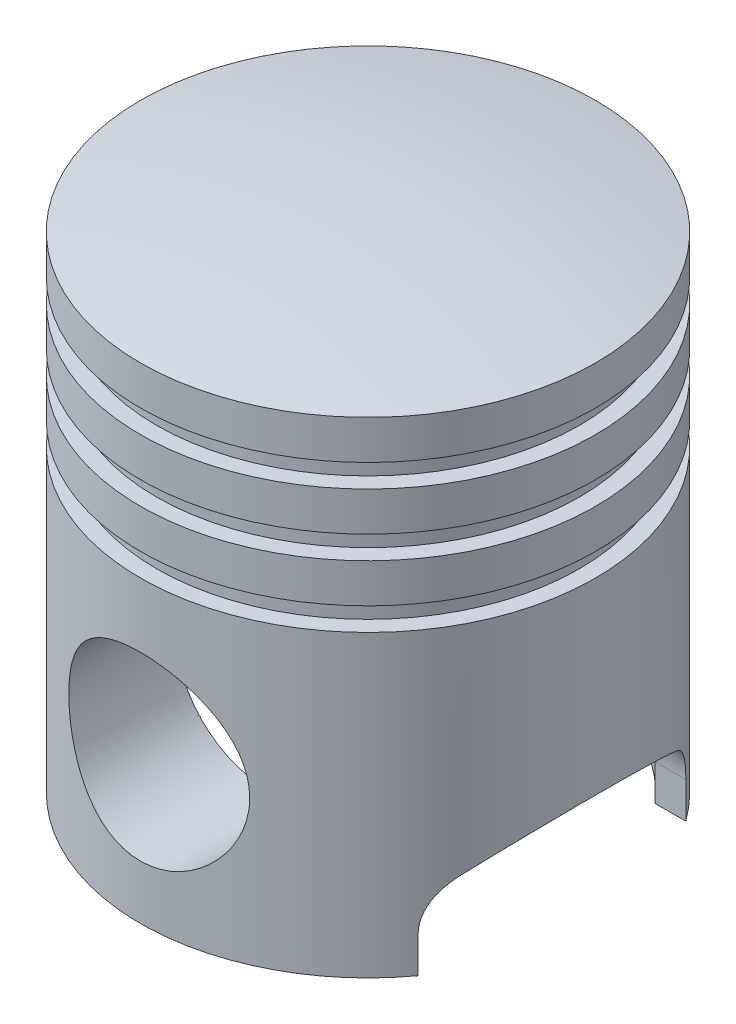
ISO-10303-21;
HEADER;
FILE_DESCRIPTION(('STEP AP214'),'2;1');
FILE_NAME('part.step','',(''),(''),'','','');
FILE_SCHEMA(('AUTOMOTIVE_DESIGN { 1 0 10303 214 1 1 1 1 }'));
ENDSEC;
DATA;
#1=APPLICATION_CONTEXT('core data for automotive mechanical design processes');
#2=APPLICATION_PROTOCOL_DEFINITION('international standard','automotive_design',2000,#1);
#3=PRODUCT_CONTEXT('',#1,'mechanical');
#4=PRODUCT('Part','Part','',(#3));
#5=PRODUCT_RELATED_PRODUCT_CATEGORY('part','',(#4));
#6=PRODUCT_DEFINITION_FORMATION('','',#4);
#7=PRODUCT_DEFINITION_CONTEXT('part definition',#1,'design');
#8=PRODUCT_DEFINITION('design','',#6,#7);
#9=PRODUCT_DEFINITION_SHAPE('','',#8);
#10=(LENGTH_UNIT() NAMED_UNIT(*) SI_UNIT(.MILLI.,.METRE.));
#11=(NAMED_UNIT(*) PLANE_ANGLE_UNIT() SI_UNIT($,.RADIAN.));
#12=(NAMED_UNIT(*) SI_UNIT($,.STERADIAN.) SOLID_ANGLE_UNIT());
#13=UNCERTAINTY_MEASURE_WITH_UNIT(LENGTH_MEASURE(1.E-05),#10,'distance_accuracy_value','');
#14=(GEOMETRIC_REPRESENTATION_CONTEXT(3) GLOBAL_UNCERTAINTY_ASSIGNED_CONTEXT((#13)) GLOBAL_UNIT_ASSIGNED_CONTEXT((#10,
#11,#12)) REPRESENTATION_CONTEXT('',''));
#15=CARTESIAN_POINT('',(0.,0.,0.));
#16=DIRECTION('',(0.,0.,1.));
#17=DIRECTION('',(1.,0.,0.));
#18=AXIS2_PLACEMENT_3D('',#15,#16,#17);
#19=CARTESIAN_POINT('',(0.,85.,0.));
#20=DIRECTION('',(0.,-1.,0.));
#21=DIRECTION('',(0.,0.,-1.));
#22=AXIS2_PLACEMENT_3D('',#19,#20,#21);
#23=CYLINDRICAL_SURFACE('',#22,38.);
#24=CARTESIAN_POINT('',(0.,49.5,-38.));
#25=CARTESIAN_POINT('',(-0.576983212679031,49.4999953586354,-37.9999957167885));
#26=CARTESIAN_POINT('',(-1.1541481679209,49.4777701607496,-37.9868245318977));
#27=CARTESIAN_POINT('',(-2.30414335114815,49.3891466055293,-37.9344519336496));
#28=CARTESIAN_POINT('',(-2.87697060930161,49.3227203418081,-37.8952340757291));
#29=CARTESIAN_POINT('',(-4.0149619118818,49.1463843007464,-37.7916291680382));
#30=CARTESIAN_POINT('',(-4.58010501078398,49.0363736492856,-37.7271837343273));
#31=CARTESIAN_POINT('',(-5.69718254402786,48.774325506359,-37.5747243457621));
#32=CARTESIAN_POINT('',(-6.24911892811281,48.6222942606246,-37.4867138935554));
#33=CARTESIAN_POINT('',(-7.33360514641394,48.2788667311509,-37.2896835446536));
#34=CARTESIAN_POINT('',(-7.86623762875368,48.0876696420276,-37.1807701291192));
#35=CARTESIAN_POINT('',(-8.91200615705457,47.6674562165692,-36.9440606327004));
#36=CARTESIAN_POINT('',(-9.42514154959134,47.4384386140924,-36.8162639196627));
#37=CARTESIAN_POINT('',(-10.4291857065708,46.9447966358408,-36.5445273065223));
#38=CARTESIAN_POINT('',(-10.920104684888,46.6801888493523,-36.4005949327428));
#39=CARTESIAN_POINT('',(-11.8779889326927,46.1173230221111,-36.0993838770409));
#40=CARTESIAN_POINT('',(-12.3449517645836,45.8190615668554,-35.9421038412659));
#41=CARTESIAN_POINT('',(-13.287438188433,45.1671833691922,-35.6049569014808));
#42=CARTESIAN_POINT('',(-13.7609592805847,44.8110896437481,-35.4242809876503));
#43=CARTESIAN_POINT('',(-14.6766246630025,44.0644579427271,-35.0548210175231));
#44=CARTESIAN_POINT('',(-15.1187675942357,43.6739184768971,-34.8660366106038));
#45=CARTESIAN_POINT('',(-15.9706649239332,42.8598668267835,-34.4841413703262));
#46=CARTESIAN_POINT('',(-16.3803802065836,42.4363160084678,-34.2910256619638));
#47=CARTESIAN_POINT('',(-17.1653872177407,41.5583749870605,-33.9048795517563));
#48=CARTESIAN_POINT('',(-17.5406771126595,41.1039831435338,-33.7118491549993));
#49=CARTESIAN_POINT('',(-18.2977853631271,40.1101586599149,-33.3076025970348));
#50=CARTESIAN_POINT('',(-18.6750801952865,39.5670368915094,-33.0969511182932));
#51=CARTESIAN_POINT('',(-19.3822748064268,38.4462454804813,-32.6878323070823));
#52=CARTESIAN_POINT('',(-19.7121670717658,37.8685703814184,-32.4893669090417));
#53=CARTESIAN_POINT('',(-20.3212636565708,36.6819630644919,-32.1119057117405));
#54=CARTESIAN_POINT('',(-20.6005332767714,36.0730724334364,-31.9328849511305));
#55=CARTESIAN_POINT('',(-21.1055853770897,34.8266218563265,-31.6013551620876));
#56=CARTESIAN_POINT('',(-21.3313871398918,34.1890723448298,-31.4488365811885));
#57=CARTESIAN_POINT('',(-21.6795046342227,33.0430392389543,-31.2094941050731));
#58=CARTESIAN_POINT('',(-21.8136670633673,32.5395911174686,-31.1156604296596));
#59=CARTESIAN_POINT('',(-22.0472840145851,31.5210734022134,-30.9505700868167));
#60=CARTESIAN_POINT('',(-22.1467438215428,31.0060055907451,-30.8793099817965));
#61=CARTESIAN_POINT('',(-22.3095805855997,29.9678900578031,-30.7618712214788));
#62=CARTESIAN_POINT('',(-22.3729942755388,29.4448510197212,-30.7156670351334));
#63=CARTESIAN_POINT('',(-22.4629722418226,28.3939126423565,-30.6499267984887));
#64=CARTESIAN_POINT('',(-22.4895358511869,27.8660132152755,-30.630391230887));
#65=CARTESIAN_POINT('',(-22.5054101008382,26.8084047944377,-30.6187298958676));
#66=CARTESIAN_POINT('',(-22.4946541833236,26.2786942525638,-30.6266530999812));
#67=CARTESIAN_POINT('',(-22.4359123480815,25.2224677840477,-30.6697105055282));
#68=CARTESIAN_POINT('',(-22.3879262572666,24.6959518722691,-30.7048448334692));
#69=CARTESIAN_POINT('',(-22.2554109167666,23.6496298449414,-30.8010284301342));
#70=CARTESIAN_POINT('',(-22.1708587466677,23.1298281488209,-30.86209395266));
#71=CARTESIAN_POINT('',(-21.9663766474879,22.1006535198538,-31.0079670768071));
#72=CARTESIAN_POINT('',(-21.8464458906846,21.5912808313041,-31.0927752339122));
#73=CARTESIAN_POINT('',(-21.5741030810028,20.5911070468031,-31.2823474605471));
#74=CARTESIAN_POINT('',(-21.4220469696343,20.1001667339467,-31.386891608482));
#75=CARTESIAN_POINT('',(-21.0861657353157,19.1332543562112,-31.6135199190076));
#76=CARTESIAN_POINT('',(-20.9023278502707,18.6572883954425,-31.7356111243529));
#77=CARTESIAN_POINT('',(-20.5044195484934,17.7222328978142,-31.9941407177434));
#78=CARTESIAN_POINT('',(-20.2903492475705,17.2631432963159,-32.1305790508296));
#79=CARTESIAN_POINT('',(-19.8333530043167,16.3631354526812,-32.4146649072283));
#80=CARTESIAN_POINT('',(-19.5904236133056,15.9222193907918,-32.5623137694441));
#81=CARTESIAN_POINT('',(-19.0330799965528,14.985956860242,-32.8916971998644));
#82=CARTESIAN_POINT('',(-18.7135440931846,14.4941850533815,-33.0749448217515));
#83=CARTESIAN_POINT('',(-18.0384131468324,13.5386503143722,-33.4479357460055));
#84=CARTESIAN_POINT('',(-17.6828150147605,13.0748897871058,-33.6376796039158));
#85=CARTESIAN_POINT('',(-16.936807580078,12.1765149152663,-34.0194096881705));
#86=CARTESIAN_POINT('',(-16.546369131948,11.7419255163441,-34.2113976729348));
#87=CARTESIAN_POINT('',(-15.7323762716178,10.9039265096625,-34.5932721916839));
#88=CARTESIAN_POINT('',(-15.3088200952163,10.5005185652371,-34.7831586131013));
#89=CARTESIAN_POINT('',(-14.3719087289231,9.67552085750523,-35.1815345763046));
#90=CARTESIAN_POINT('',(-13.8540833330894,9.2585729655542,-35.3891665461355));
#91=CARTESIAN_POINT('',(-12.7800619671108,8.46991887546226,-35.7910435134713));
#92=CARTESIAN_POINT('',(-12.2238621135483,8.09821726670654,-35.9852871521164));
#93=CARTESIAN_POINT('',(-11.0761231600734,7.40359204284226,-36.354955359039));
#94=CARTESIAN_POINT('',(-10.4845982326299,7.08064904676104,-36.5303873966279));
#95=CARTESIAN_POINT('',(-9.2695806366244,6.48703198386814,-36.8574345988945));
#96=CARTESIAN_POINT('',(-8.64609196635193,6.21635139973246,-37.0090527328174));
#97=CARTESIAN_POINT('',(-7.41310420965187,5.74671025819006,-37.2748890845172));
#98=CARTESIAN_POINT('',(-6.80533362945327,5.54422957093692,-37.3908986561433));
#99=CARTESIAN_POINT('',(-5.57029176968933,5.19095913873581,-37.5947259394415));
#100=CARTESIAN_POINT('',(-4.94302109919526,5.04016778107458,-37.68254453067));
#101=CARTESIAN_POINT('',(-3.6749731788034,4.79276105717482,-37.8272573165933));
#102=CARTESIAN_POINT('',(-3.03420929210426,4.69609448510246,-37.8841807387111));
#103=CARTESIAN_POINT('',(-1.74470868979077,4.55838123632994,-37.9654200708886));
#104=CARTESIAN_POINT('',(-1.09597303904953,4.51732721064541,-37.989740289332));
#105=CARTESIAN_POINT('',(0.117222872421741,4.49323693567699,-38.0040049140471));
#106=CARTESIAN_POINT('',(0.681511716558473,4.5032618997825,-37.998060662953));
#107=CARTESIAN_POINT('',(1.80688464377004,4.56559207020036,-37.961190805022));
#108=CARTESIAN_POINT('',(2.36796906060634,4.61789278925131,-37.9302678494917));
#109=CARTESIAN_POINT('',(3.48277372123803,4.76407488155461,-37.8441922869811));
#110=CARTESIAN_POINT('',(4.03649412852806,4.85795533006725,-37.7890402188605));
#111=CARTESIAN_POINT('',(5.13273045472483,5.08611067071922,-37.6558093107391));
#112=CARTESIAN_POINT('',(5.67524607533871,5.22038663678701,-37.5777298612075));
#113=CARTESIAN_POINT('',(6.73473685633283,5.52464313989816,-37.4022170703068));
#114=CARTESIAN_POINT('',(7.25200676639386,5.69384535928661,-37.3052077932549));
#115=CARTESIAN_POINT('',(8.26961798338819,6.06779334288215,-37.0929048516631));
#116=CARTESIAN_POINT('',(8.76995975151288,6.2725381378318,-36.9776116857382));
#117=CARTESIAN_POINT('',(9.75140196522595,6.71576645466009,-36.7309981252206));
#118=CARTESIAN_POINT('',(10.2325005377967,6.95425325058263,-36.5996761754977));
#119=CARTESIAN_POINT('',(11.1734608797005,7.46311399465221,-36.3234670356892));
#120=CARTESIAN_POINT('',(11.6333213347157,7.73348991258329,-36.1785790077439));
#121=CARTESIAN_POINT('',(12.5768932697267,8.33408897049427,-35.8621589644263));
#122=CARTESIAN_POINT('',(13.058102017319,8.66761230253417,-35.6894235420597));
#123=CARTESIAN_POINT('',(13.9908449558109,9.36914997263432,-35.3341955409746));
#124=CARTESIAN_POINT('',(14.4423774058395,9.73716633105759,-35.1517023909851));
#125=CARTESIAN_POINT('',(15.3146966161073,10.5061077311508,-34.7805258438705));
#126=CARTESIAN_POINT('',(15.7354499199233,10.9070676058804,-34.5918360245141));
#127=CARTESIAN_POINT('',(16.5442730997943,11.7397908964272,-34.2123751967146));
#128=CARTESIAN_POINT('',(16.9323413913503,12.1715558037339,-34.0216040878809));
#129=CARTESIAN_POINT('',(17.7209310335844,13.1203267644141,-33.618276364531));
#130=CARTESIAN_POINT('',(18.1169123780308,13.6412327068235,-33.4059875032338));
#131=CARTESIAN_POINT('',(18.8635267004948,14.7180355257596,-32.9901503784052));
#132=CARTESIAN_POINT('',(19.2141525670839,15.2739378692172,-32.7866034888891));
#133=CARTESIAN_POINT('',(19.8671467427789,16.417946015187,-32.3950813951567));
#134=CARTESIAN_POINT('',(20.1695586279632,17.0060220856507,-32.2070922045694));
#135=CARTESIAN_POINT('',(20.7234731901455,18.2120730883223,-31.853503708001));
#136=CARTESIAN_POINT('',(20.9749915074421,18.8300387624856,-31.6878975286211));
#137=CARTESIAN_POINT('',(21.3753315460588,19.9557883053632,-31.4187863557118));
#138=CARTESIAN_POINT('',(21.5346000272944,20.4585169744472,-31.3095953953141));
#139=CARTESIAN_POINT('',(21.818235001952,21.4778312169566,-31.1126097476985));
#140=CARTESIAN_POINT('',(21.9426062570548,21.9944148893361,-31.0248121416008));
#141=CARTESIAN_POINT('',(22.1548069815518,23.0379685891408,-30.873638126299));
#142=CARTESIAN_POINT('',(22.2426775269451,23.5649262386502,-30.8102342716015));
#143=CARTESIAN_POINT('',(22.380836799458,24.626289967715,-30.7100223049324));
#144=CARTESIAN_POINT('',(22.4311252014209,25.1606961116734,-30.6732144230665));
#145=CARTESIAN_POINT('',(22.4934341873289,26.2346989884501,-30.6275519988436));
#146=CARTESIAN_POINT('',(22.5053291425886,26.7743069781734,-30.6187892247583));
#147=CARTESIAN_POINT('',(22.490302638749,27.8526863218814,-30.6298280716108));
#148=CARTESIAN_POINT('',(22.4633810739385,28.3914576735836,-30.64962977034));
#149=CARTESIAN_POINT('',(22.3711360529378,29.4641971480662,-30.7170230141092));
#150=CARTESIAN_POINT('',(22.3057932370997,29.9981627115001,-30.7646285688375));
#151=CARTESIAN_POINT('',(22.1376837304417,31.057144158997,-30.8858163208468));
#152=CARTESIAN_POINT('',(22.0349167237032,31.582159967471,-30.959398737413));
#153=CARTESIAN_POINT('',(21.7981185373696,32.5994634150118,-31.1265502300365));
#154=CARTESIAN_POINT('',(21.6654779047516,33.0922257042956,-31.2192181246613));
#155=CARTESIAN_POINT('',(21.368318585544,34.0642312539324,-31.4233581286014));
#156=CARTESIAN_POINT('',(21.2037872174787,34.5434690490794,-31.5348377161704));
#157=CARTESIAN_POINT('',(20.8443490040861,35.4863232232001,-31.7735680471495));
#158=CARTESIAN_POINT('',(20.6494423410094,35.9499396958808,-31.9008186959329));
#159=CARTESIAN_POINT('',(20.2306456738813,36.8601215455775,-32.1680380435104));
#160=CARTESIAN_POINT('',(20.0067520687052,37.3066847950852,-32.3080083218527));
#161=CARTESIAN_POINT('',(19.4945131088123,38.2491954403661,-32.6200433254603));
#162=CARTESIAN_POINT('',(19.2015548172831,38.7421044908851,-32.793724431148));
#163=CARTESIAN_POINT('',(18.580501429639,39.7020405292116,-33.1495559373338));
#164=CARTESIAN_POINT('',(18.252403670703,40.1690655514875,-33.3317069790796));
#165=CARTESIAN_POINT('',(17.5623739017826,41.0761488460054,-33.700387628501));
#166=CARTESIAN_POINT('',(17.2004181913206,41.5161878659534,-33.8869202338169));
#167=CARTESIAN_POINT('',(16.4442520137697,42.3675228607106,-34.2602452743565));
#168=CARTESIAN_POINT('',(16.0500396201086,42.7788171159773,-34.4470377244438));
#169=CARTESIAN_POINT('',(15.1681694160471,43.6315355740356,-34.8453002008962));
#170=CARTESIAN_POINT('',(14.6754278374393,44.0679938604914,-35.0561909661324));
#171=CARTESIAN_POINT('',(13.6508991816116,44.8979781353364,-35.4677000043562));
#172=CARTESIAN_POINT('',(13.1191075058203,45.2914990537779,-35.6683170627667));
#173=CARTESIAN_POINT('',(12.0186886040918,46.0326379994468,-36.0540030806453));
#174=CARTESIAN_POINT('',(11.4500451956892,46.3802356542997,-36.2390651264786));
#175=CARTESIAN_POINT('',(10.2792182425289,47.0258439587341,-36.5883961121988));
#176=CARTESIAN_POINT('',(9.6770393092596,47.3238614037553,-36.7526679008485));
#177=CARTESIAN_POINT('',(8.46701586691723,47.8561574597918,-37.0497295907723));
#178=CARTESIAN_POINT('',(7.86030701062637,48.0924676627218,-37.1834969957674));
#179=CARTESIAN_POINT('',(6.62359422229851,48.5128912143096,-37.4235844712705));
#180=CARTESIAN_POINT('',(5.99358633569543,48.6969956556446,-37.5298998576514));
#181=CARTESIAN_POINT('',(4.71783722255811,49.0095874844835,-37.7114811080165));
#182=CARTESIAN_POINT('',(4.07215629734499,49.1382605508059,-37.7868505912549));
#183=CARTESIAN_POINT('',(2.76941573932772,49.3386198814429,-37.9045815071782));
#184=CARTESIAN_POINT('',(2.11236641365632,49.410355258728,-37.9469713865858));
#185=CARTESIAN_POINT('',(1.21132826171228,49.4686783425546,-37.9814615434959));
#186=CARTESIAN_POINT('',(0.969279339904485,49.4804191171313,-37.9884088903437));
#187=CARTESIAN_POINT('',(0.484830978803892,49.496081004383,-37.9976790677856));
#188=CARTESIAN_POINT('',(0.242431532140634,49.5000019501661,-38.0000017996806));
#189=CARTESIAN_POINT('',(0.,49.5,-38.));
#190=B_SPLINE_CURVE_WITH_KNOTS('',3,(#24,#25,#26,#27,#28,#29,#30,#31,#32,#33,#34,#35,#36,#37,
#38,#39,#40,#41,#42,#43,#44,#45,#46,#47,#48,#49,#50,#51,#52,#53,#54,#55,#56,#57,#58,#59,#60,#61,
#62,#63,#64,#65,#66,#67,#68,#69,#70,#71,#72,#73,#74,#75,#76,#77,#78,#79,#80,#81,#82,#83,#84,#85,
#86,#87,#88,#89,#90,#91,#92,#93,#94,#95,#96,#97,#98,#99,#100,#101,#102,#103,#104,#105,#106,#107,
#108,#109,#110,#111,#112,#113,#114,#115,#116,#117,#118,#119,#120,#121,#122,#123,#124,#125,#126,
#127,#128,#129,#130,#131,#132,#133,#134,#135,#136,#137,#138,#139,#140,#141,#142,#143,#144,#145,
#146,#147,#148,#149,#150,#151,#152,#153,#154,#155,#156,#157,#158,#159,#160,#161,#162,#163,#164,
#165,#166,#167,#168,#169,#170,#171,#172,#173,#174,#175,#176,#177,#178,#179,#180,#181,#182,#183,
#184,#185,#186,#187,#188,#189),.UNSPECIFIED.,.T.,.F.,(4,2,2,2,2,2,2,2,2,2,2,2,2,2,2,2,2,2,2,2,2,
2,2,2,2,2,2,2,2,2,2,2,2,2,2,2,2,2,2,2,2,2,2,2,2,2,2,2,2,2,2,2,2,2,2,2,2,2,2,2,2,2,2,2,2,2,2,2,2,
2,2,2,2,2,2,2,2,2,2,2,2,2,4),(0.,1.73069107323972,3.46247585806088,5.19829241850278,
6.93385111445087,8.66079278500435,10.3877922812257,12.1139895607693,13.8403621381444,
15.6967139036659,17.5531460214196,19.4117843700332,21.2705216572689,23.3501325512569,
25.4300727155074,27.5073104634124,29.5837979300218,31.1704026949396,32.7567657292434,
34.3415092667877,35.9262814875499,37.5138815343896,39.1014889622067,40.6900929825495,
42.2787341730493,43.8506190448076,45.4231365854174,46.9956481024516,48.5683477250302,
50.4098064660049,52.2514230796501,54.0945949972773,55.9378651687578,58.0247158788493,
60.1117780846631,62.1980085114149,64.2839786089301,66.2342490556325,68.1844586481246,
70.1328200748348,72.0809240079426,73.77205305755,75.4630026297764,77.1539145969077,
78.8448715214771,80.5015767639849,82.1582368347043,83.8150577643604,85.4719810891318,
87.3014409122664,89.1310079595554,90.9625350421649,92.7941508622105,94.8554336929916,
96.9170393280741,98.9767709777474,101.035868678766,102.649903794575,104.263718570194,
105.875712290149,107.487719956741,109.104997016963,110.722278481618,112.340375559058,
113.958486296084,115.512876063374,117.067885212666,118.622885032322,120.178078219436,
121.973699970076,123.769457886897,125.566482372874,127.36361426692,129.434725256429,
131.506080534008,133.578351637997,135.650338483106,137.641565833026,139.633132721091,
141.617975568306,143.601104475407,144.328274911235,145.055460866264),.UNSPECIFIED.);
#191=CARTESIAN_POINT('',(0.,49.5,-38.));
#192=VERTEX_POINT('',#191);
#193=EDGE_CURVE('E11',#192,#192,#190,.T.);
#194=ORIENTED_EDGE('',*,*,#193,.F.);
#195=EDGE_LOOP('',(#194));
#196=FACE_BOUND('',#195,.T.);
#197=CARTESIAN_POINT('',(0.,85.,0.));
#198=DIRECTION('',(0.,-1.,0.));
#199=DIRECTION('',(0.,0.,-1.));
#200=AXIS2_PLACEMENT_3D('',#197,#198,#199);
#201=CIRCLE('',#200,38.);
#202=CARTESIAN_POINT('',(0.,85.,-38.));
#203=VERTEX_POINT('',#202);
#204=EDGE_CURVE('E347',#203,#203,#201,.T.);
#205=ORIENTED_EDGE('',*,*,#204,.F.);
#206=EDGE_LOOP('',(#205));
#207=FACE_BOUND('',#206,.T.);
#208=DIRECTION('',(0.,-1.,0.));
#209=VECTOR('',#208,1.);
#210=CARTESIAN_POINT('',(-28.6181760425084,85.,-25.));
#211=LINE('',#210,#209);
#212=CARTESIAN_POINT('',(-28.6181760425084,0.,-25.));
#213=VERTEX_POINT('',#212);
#214=CARTESIAN_POINT('',(-28.6181760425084,6.75577212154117,-25.));
#215=VERTEX_POINT('',#214);
#216=EDGE_CURVE('E328',#213,#215,#211,.F.);
#217=ORIENTED_EDGE('',*,*,#216,.F.);
#218=CARTESIAN_POINT('',(0.,0.,0.));
#219=DIRECTION('',(0.,-1.,0.));
#220=DIRECTION('',(0.,0.,-1.));
#221=AXIS2_PLACEMENT_3D('',#218,#219,#220);
#222=CIRCLE('',#221,38.);
#223=CARTESIAN_POINT('',(28.6181760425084,0.,-25.));
#224=VERTEX_POINT('',#223);
#225=EDGE_CURVE('E337',#213,#224,#222,.T.);
#226=ORIENTED_EDGE('',*,*,#225,.T.);
#227=DIRECTION('',(0.,-1.,0.));
#228=VECTOR('',#227,1.);
#229=CARTESIAN_POINT('',(28.6181760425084,85.,-25.));
#230=LINE('',#229,#228);
#231=CARTESIAN_POINT('',(28.6181760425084,6.75577212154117,-25.));
#232=VERTEX_POINT('',#231);
#233=EDGE_CURVE('E183',#232,#224,#230,.T.);
#234=ORIENTED_EDGE('',*,*,#233,.F.);
#235=CARTESIAN_POINT('',(28.6181760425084,6.75577212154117,-25.));
#236=CARTESIAN_POINT('',(28.6181732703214,6.87522037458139,-25.0000016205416));
#237=CARTESIAN_POINT('',(28.6200463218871,6.99465004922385,-24.997859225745));
#238=CARTESIAN_POINT('',(28.6275134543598,7.23323302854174,-24.9893081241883));
#239=CARTESIAN_POINT('',(28.6331073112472,7.3523863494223,-24.9828996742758));
#240=CARTESIAN_POINT('',(28.6554074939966,7.70882263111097,-24.9573269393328));
#241=CARTESIAN_POINT('',(28.6776325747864,7.94535616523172,-24.9318151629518));
#242=CARTESIAN_POINT('',(28.7358688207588,8.41209910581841,-24.8646692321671));
#243=CARTESIAN_POINT('',(28.7717520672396,8.64234656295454,-24.8231846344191));
#244=CARTESIAN_POINT('',(28.8563267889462,9.09715319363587,-24.7248176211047));
#245=CARTESIAN_POINT('',(28.9050204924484,9.32171137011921,-24.6679325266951));
#246=CARTESIAN_POINT('',(29.0138105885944,9.76297053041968,-24.5398819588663));
#247=CARTESIAN_POINT('',(29.0738667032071,9.9796961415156,-24.4687668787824));
#248=CARTESIAN_POINT('',(29.2041508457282,10.4050318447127,-24.3131218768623));
#249=CARTESIAN_POINT('',(29.2743785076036,10.6136422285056,-24.228592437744));
#250=CARTESIAN_POINT('',(29.4987741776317,11.227375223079,-23.9557438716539));
#251=CARTESIAN_POINT('',(29.6664006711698,11.6194082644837,-23.7484581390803));
#252=CARTESIAN_POINT('',(29.9708922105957,12.2482063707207,-23.3620645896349));
#253=CARTESIAN_POINT('',(30.101145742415,12.4953836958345,-23.194194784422));
#254=CARTESIAN_POINT('',(30.3708884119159,12.970635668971,-22.8398478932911));
#255=CARTESIAN_POINT('',(30.5103764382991,13.1987126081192,-22.6533730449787));
#256=CARTESIAN_POINT('',(30.796067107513,13.6353211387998,-22.2634387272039));
#257=CARTESIAN_POINT('',(30.9422712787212,13.8438482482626,-22.0599753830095));
#258=CARTESIAN_POINT('',(31.2391185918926,14.2408725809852,-21.6375617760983));
#259=CARTESIAN_POINT('',(31.3897598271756,14.4293782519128,-21.4186181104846));
#260=CARTESIAN_POINT('',(31.6689847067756,14.7571360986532,-21.0030354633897));
#261=CARTESIAN_POINT('',(31.7971913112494,14.8994215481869,-20.8085235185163));
#262=CARTESIAN_POINT('',(32.0539626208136,15.1689176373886,-20.4107697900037));
#263=CARTESIAN_POINT('',(32.1825246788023,15.2961772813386,-20.20755950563));
#264=CARTESIAN_POINT('',(32.310988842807,15.4160261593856,-20.));
#265=B_SPLINE_CURVE_WITH_KNOTS('',3,(#235,#236,#237,#238,#239,#240,#241,#242,#243,#244,#245,
#246,#247,#248,#249,#250,#251,#252,#253,#254,#255,#256,#257,#258,#259,#260,#261,#262,#263,#264),
.UNSPECIFIED.,.F.,.F.,(4,2,2,2,2,2,2,2,2,2,2,2,2,2,4),(0.,0.358274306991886,0.716527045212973,
1.4322130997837,2.1413548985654,2.85062012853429,3.55741669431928,4.26418783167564,
5.68089152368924,6.65766947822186,7.6343300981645,8.61121408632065,9.58768424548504,
10.4060779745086,11.2217242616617),.UNSPECIFIED.);
#266=CARTESIAN_POINT('',(32.310988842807,15.4160261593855,-20.));
#267=VERTEX_POINT('',#266);
#268=EDGE_CURVE('E60',#232,#267,#265,.T.);
#269=ORIENTED_EDGE('',*,*,#268,.T.);
#270=CARTESIAN_POINT('',(28.6181760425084,12.,25.));
#271=CARTESIAN_POINT('',(29.1922818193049,12.5262205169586,24.3427614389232));
#272=CARTESIAN_POINT('',(29.7493245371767,13.0392479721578,23.6594393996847));
#273=CARTESIAN_POINT('',(30.8251213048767,14.0337717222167,22.2397600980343));
#274=CARTESIAN_POINT('',(31.343821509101,14.5152235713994,21.503331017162));
#275=CARTESIAN_POINT('',(32.34099451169,15.4435370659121,19.9724963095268));
#276=CARTESIAN_POINT('',(32.8191258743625,15.8901030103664,19.1776870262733));
#277=CARTESIAN_POINT('',(33.7244309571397,16.7376558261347,17.5368202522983));
#278=CARTESIAN_POINT('',(34.1516313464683,17.1386665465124,16.6907899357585));
#279=CARTESIAN_POINT('',(34.8845871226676,17.8279658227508,15.0900890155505));
#280=CARTESIAN_POINT('',(35.1988219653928,18.124008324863,14.3426363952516));
#281=CARTESIAN_POINT('',(35.782991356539,18.6750503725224,12.8158278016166));
#282=CARTESIAN_POINT('',(36.0529261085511,18.9300501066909,12.0364719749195));
#283=CARTESIAN_POINT('',(36.5437377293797,19.3941556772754,10.4518451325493));
#284=CARTESIAN_POINT('',(36.7647595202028,19.6033970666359,9.64665899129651));
#285=CARTESIAN_POINT('',(37.1550789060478,19.9731730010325,8.01282817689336));
#286=CARTESIAN_POINT('',(37.3243774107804,20.1337084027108,7.18418391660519));
#287=CARTESIAN_POINT('',(37.6091009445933,20.4038180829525,5.50336331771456));
#288=CARTESIAN_POINT('',(37.7241434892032,20.5130305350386,4.65106348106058));
#289=CARTESIAN_POINT('',(37.8962658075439,20.6764665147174,2.9353518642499));
#290=CARTESIAN_POINT('',(37.9533449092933,20.7306894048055,2.0719399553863));
#291=CARTESIAN_POINT('',(38.0083367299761,20.7829290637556,0.341133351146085));
#292=CARTESIAN_POINT('',(38.0062223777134,20.7809201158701,-0.526262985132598));
#293=CARTESIAN_POINT('',(37.9428008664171,20.7206735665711,-2.25687701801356));
#294=CARTESIAN_POINT('',(37.881497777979,20.662439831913,-3.12009499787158));
#295=CARTESIAN_POINT('',(37.7099008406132,20.4995110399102,-4.75058232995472));
#296=CARTESIAN_POINT('',(37.6050112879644,20.3999421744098,-5.51894691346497));
#297=CARTESIAN_POINT('',(37.349929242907,20.1579452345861,-7.04118405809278));
#298=CARTESIAN_POINT('',(37.19974018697,20.0155204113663,-7.79505771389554));
#299=CARTESIAN_POINT('',(36.8563837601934,19.6901743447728,-9.28389149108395));
#300=CARTESIAN_POINT('',(36.6632209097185,19.5072573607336,-10.0188535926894));
#301=CARTESIAN_POINT('',(36.2366159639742,19.1036880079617,-11.466345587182));
#302=CARTESIAN_POINT('',(36.0031720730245,18.8830339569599,-12.1788744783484));
#303=CARTESIAN_POINT('',(35.4834267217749,18.3923700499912,-13.6216737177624));
#304=CARTESIAN_POINT('',(35.1947574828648,18.1201593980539,-14.3503402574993));
#305=CARTESIAN_POINT('',(34.5789158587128,17.5403557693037,-15.7766328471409));
#306=CARTESIAN_POINT('',(34.2517402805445,17.2327598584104,-16.4742563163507));
#307=CARTESIAN_POINT('',(33.5622481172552,16.5857665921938,-17.8370097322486));
#308=CARTESIAN_POINT('',(33.1999154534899,16.2463546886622,-18.5021246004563));
#309=CARTESIAN_POINT('',(32.4435136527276,15.5394096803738,-19.798530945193));
#310=CARTESIAN_POINT('',(32.0494397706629,15.171872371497,-20.429817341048));
#311=CARTESIAN_POINT('',(31.1714895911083,14.355242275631,-21.7498724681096));
#312=CARTESIAN_POINT('',(30.6829961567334,13.9021721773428,-22.4331222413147));
#313=CARTESIAN_POINT('',(29.9258667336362,13.2025946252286,-23.4225162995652));
#314=CARTESIAN_POINT('',(29.6698679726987,12.966479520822,-23.7458961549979));
#315=CARTESIAN_POINT('',(29.1498989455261,12.4878829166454,-24.3813832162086));
#316=CARTESIAN_POINT('',(28.8859282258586,12.2454010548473,-24.693489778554));
#317=CARTESIAN_POINT('',(28.6181760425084,12.,-25.));
#318=B_SPLINE_CURVE_WITH_KNOTS('',3,(#270,#271,#272,#273,#274,#275,#276,#277,#278,#279,#280,
#281,#282,#283,#284,#285,#286,#287,#288,#289,#290,#291,#292,#293,#294,#295,#296,#297,#298,#299,
#300,#301,#302,#303,#304,#305,#306,#307,#308,#309,#310,#311,#312,#313,#314,#315,#316,#317),
.UNSPECIFIED.,.F.,.F.,(4,2,2,2,2,2,2,2,2,2,2,2,2,2,2,2,2,2,2,2,2,2,2,4),(0.,3.05719266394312,
6.11860013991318,9.20363955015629,12.2870563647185,14.874095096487,17.4611219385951,
20.0403780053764,22.6195887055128,25.2167197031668,27.8138808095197,30.4122297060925,
33.0103999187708,35.3533343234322,37.6960910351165,40.0386014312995,42.3812162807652,
44.8679001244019,47.3547903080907,49.8428232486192,52.3312288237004,55.1917108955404,
56.6172531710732,58.0428766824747),.UNSPECIFIED.);
#319=CARTESIAN_POINT('',(32.310988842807,15.4160261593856,20.));
#320=VERTEX_POINT('',#319);
#321=EDGE_CURVE('E174',#320,#267,#318,.T.);
#322=ORIENTED_EDGE('',*,*,#321,.F.);
#323=CARTESIAN_POINT('',(32.310988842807,15.4160261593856,20.));
#324=CARTESIAN_POINT('',(32.1497784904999,15.2655936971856,20.2604926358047));
#325=CARTESIAN_POINT('',(31.9883798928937,15.1035042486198,20.5141522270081));
#326=CARTESIAN_POINT('',(31.667093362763,14.7564371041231,21.0066946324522));
#327=CARTESIAN_POINT('',(31.5072067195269,14.5714414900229,21.2455656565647));
#328=CARTESIAN_POINT('',(31.1898555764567,14.1776929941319,21.7088099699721));
#329=CARTESIAN_POINT('',(31.032419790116,13.968765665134,21.9330552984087));
#330=CARTESIAN_POINT('',(30.7238205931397,13.5289977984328,22.3632963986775));
#331=CARTESIAN_POINT('',(30.572654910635,13.2981652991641,22.5692988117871));
#332=CARTESIAN_POINT('',(30.1867332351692,12.6624470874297,23.0850541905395));
#333=CARTESIAN_POINT('',(29.9591929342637,12.2393941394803,23.3785827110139));
#334=CARTESIAN_POINT('',(29.6470697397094,11.5651509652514,23.7714004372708));
#335=CARTESIAN_POINT('',(29.5479751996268,11.3340358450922,23.8943309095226));
#336=CARTESIAN_POINT('',(29.3614060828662,10.858983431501,24.1232158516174));
#337=CARTESIAN_POINT('',(29.2739286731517,10.6150492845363,24.2291744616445));
#338=CARTESIAN_POINT('',(29.1282304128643,10.1632943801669,24.4040279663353));
#339=CARTESIAN_POINT('',(29.0676133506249,9.95748215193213,24.4761361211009));
#340=CARTESIAN_POINT('',(28.956614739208,9.53907866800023,24.6073535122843));
#341=CARTESIAN_POINT('',(28.9062309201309,9.32648892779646,24.6664656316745));
#342=CARTESIAN_POINT('',(28.8168665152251,8.89593575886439,24.7708079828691));
#343=CARTESIAN_POINT('',(28.7778681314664,8.67798130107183,24.8160598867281));
#344=CARTESIAN_POINT('',(28.712131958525,8.23781576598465,24.8920872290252));
#345=CARTESIAN_POINT('',(28.6853883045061,8.01560677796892,24.9228695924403));
#346=CARTESIAN_POINT('',(28.6495534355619,7.62037904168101,24.9640474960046));
#347=CARTESIAN_POINT('',(28.6378059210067,7.44791228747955,24.9775163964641));
#348=CARTESIAN_POINT('',(28.6221085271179,7.10222910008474,24.9954982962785));
#349=CARTESIAN_POINT('',(28.6181555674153,6.9290129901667,25.0000148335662));
#350=CARTESIAN_POINT('',(28.6181760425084,6.75577212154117,25.));
#351=B_SPLINE_CURVE_WITH_KNOTS('',3,(#323,#324,#325,#326,#327,#328,#329,#330,#331,#332,#333,
#334,#335,#336,#337,#338,#339,#340,#341,#342,#343,#344,#345,#346,#347,#348,#349,#350),
.UNSPECIFIED.,.F.,.F.,(4,2,2,2,2,2,2,2,2,2,2,2,2,4),(0.,1.02359738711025,2.04800059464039,
3.08041356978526,4.11244913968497,5.79350583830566,6.6324090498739,7.47110730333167,
8.14950806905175,8.82775818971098,9.50494230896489,10.1818020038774,10.7015806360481,
11.2211538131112),.UNSPECIFIED.);
#352=CARTESIAN_POINT('',(28.6181760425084,6.75577212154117,25.));
#353=VERTEX_POINT('',#352);
#354=EDGE_CURVE('E277',#320,#353,#351,.T.);
#355=ORIENTED_EDGE('',*,*,#354,.T.);
#356=DIRECTION('',(0.,-1.,0.));
#357=VECTOR('',#356,1.);
#358=CARTESIAN_POINT('',(28.6181760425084,85.,25.));
#359=LINE('',#358,#357);
#360=CARTESIAN_POINT('',(28.6181760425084,0.,25.));
#361=VERTEX_POINT('',#360);
#362=EDGE_CURVE('E170',#361,#353,#359,.F.);
#363=ORIENTED_EDGE('',*,*,#362,.F.);
#364=CARTESIAN_POINT('',(-28.6181760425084,0.,25.));
#365=VERTEX_POINT('',#364);
#366=EDGE_CURVE('E342',#361,#365,#222,.T.);
#367=ORIENTED_EDGE('',*,*,#366,.T.);
#368=DIRECTION('',(0.,-1.,0.));
#369=VECTOR('',#368,1.);
#370=CARTESIAN_POINT('',(-28.6181760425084,85.,25.));
#371=LINE('',#370,#369);
#372=CARTESIAN_POINT('',(-28.6181760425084,6.75577212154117,25.));
#373=VERTEX_POINT('',#372);
#374=EDGE_CURVE('E148',#373,#365,#371,.T.);
#375=ORIENTED_EDGE('',*,*,#374,.F.);
#376=CARTESIAN_POINT('',(-28.6181760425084,6.75577212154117,25.));
#377=CARTESIAN_POINT('',(-28.6181732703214,6.87522037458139,25.0000016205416));
#378=CARTESIAN_POINT('',(-28.6200463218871,6.99465004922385,24.997859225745));
#379=CARTESIAN_POINT('',(-28.6275134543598,7.23323302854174,24.9893081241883));
#380=CARTESIAN_POINT('',(-28.6331073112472,7.3523863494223,24.9828996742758));
#381=CARTESIAN_POINT('',(-28.6554074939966,7.70882263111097,24.9573269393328));
#382=CARTESIAN_POINT('',(-28.6776325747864,7.94535616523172,24.9318151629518));
#383=CARTESIAN_POINT('',(-28.7358688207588,8.41209910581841,24.8646692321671));
#384=CARTESIAN_POINT('',(-28.7717520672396,8.64234656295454,24.8231846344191));
#385=CARTESIAN_POINT('',(-28.8563267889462,9.09715319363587,24.7248176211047));
#386=CARTESIAN_POINT('',(-28.9050204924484,9.32171137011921,24.6679325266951));
#387=CARTESIAN_POINT('',(-29.0138105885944,9.76297053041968,24.5398819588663));
#388=CARTESIAN_POINT('',(-29.0738667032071,9.9796961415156,24.4687668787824));
#389=CARTESIAN_POINT('',(-29.2041508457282,10.4050318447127,24.3131218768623));
#390=CARTESIAN_POINT('',(-29.2743785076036,10.6136422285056,24.228592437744));
#391=CARTESIAN_POINT('',(-29.4987741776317,11.227375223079,23.9557438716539));
#392=CARTESIAN_POINT('',(-29.6664006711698,11.6194082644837,23.7484581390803));
#393=CARTESIAN_POINT('',(-29.9708922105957,12.2482063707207,23.3620645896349));
#394=CARTESIAN_POINT('',(-30.101145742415,12.4953836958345,23.194194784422));
#395=CARTESIAN_POINT('',(-30.3708884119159,12.970635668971,22.8398478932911));
#396=CARTESIAN_POINT('',(-30.5103764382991,13.1987126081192,22.6533730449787));
#397=CARTESIAN_POINT('',(-30.796067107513,13.6353211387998,22.2634387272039));
#398=CARTESIAN_POINT('',(-30.9422712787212,13.8438482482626,22.0599753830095));
#399=CARTESIAN_POINT('',(-31.2391185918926,14.2408725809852,21.6375617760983));
#400=CARTESIAN_POINT('',(-31.3897598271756,14.4293782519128,21.4186181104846));
#401=CARTESIAN_POINT('',(-31.6689847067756,14.7571360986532,21.0030354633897));
#402=CARTESIAN_POINT('',(-31.7971913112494,14.8994215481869,20.8085235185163));
#403=CARTESIAN_POINT('',(-32.0539626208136,15.1689176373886,20.4107697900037));
#404=CARTESIAN_POINT('',(-32.1825246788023,15.2961772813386,20.20755950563));
#405=CARTESIAN_POINT('',(-32.310988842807,15.4160261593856,20.));
#406=B_SPLINE_CURVE_WITH_KNOTS('',3,(#376,#377,#378,#379,#380,#381,#382,#383,#384,#385,#386,
#387,#388,#389,#390,#391,#392,#393,#394,#395,#396,#397,#398,#399,#400,#401,#402,#403,#404,#405),
.UNSPECIFIED.,.F.,.F.,(4,2,2,2,2,2,2,2,2,2,2,2,2,2,4),(0.,0.358274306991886,0.716527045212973,
1.4322130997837,2.1413548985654,2.85062012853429,3.55741669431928,4.26418783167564,
5.68089152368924,6.65766947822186,7.6343300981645,8.61121408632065,9.58768424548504,
10.4060779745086,11.2217242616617),.UNSPECIFIED.);
#407=CARTESIAN_POINT('',(-32.310988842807,15.4160261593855,20.));
#408=VERTEX_POINT('',#407);
#409=EDGE_CURVE('E291',#373,#408,#406,.T.);
#410=ORIENTED_EDGE('',*,*,#409,.T.);
#411=CARTESIAN_POINT('',(-28.6181760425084,12.,-25.));
#412=CARTESIAN_POINT('',(-29.1922818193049,12.5262205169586,-24.3427614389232));
#413=CARTESIAN_POINT('',(-29.7493245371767,13.0392479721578,-23.6594393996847));
#414=CARTESIAN_POINT('',(-30.8251213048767,14.0337717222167,-22.2397600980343));
#415=CARTESIAN_POINT('',(-31.343821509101,14.5152235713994,-21.503331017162));
#416=CARTESIAN_POINT('',(-32.34099451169,15.4435370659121,-19.9724963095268));
#417=CARTESIAN_POINT('',(-32.8191258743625,15.8901030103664,-19.1776870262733));
#418=CARTESIAN_POINT('',(-33.7244309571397,16.7376558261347,-17.5368202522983));
#419=CARTESIAN_POINT('',(-34.1516313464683,17.1386665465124,-16.6907899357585));
#420=CARTESIAN_POINT('',(-34.8845871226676,17.8279658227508,-15.0900890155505));
#421=CARTESIAN_POINT('',(-35.1988219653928,18.124008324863,-14.3426363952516));
#422=CARTESIAN_POINT('',(-35.782991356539,18.6750503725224,-12.8158278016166));
#423=CARTESIAN_POINT('',(-36.0529261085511,18.9300501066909,-12.0364719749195));
#424=CARTESIAN_POINT('',(-36.5437377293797,19.3941556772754,-10.4518451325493));
#425=CARTESIAN_POINT('',(-36.7647595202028,19.6033970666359,-9.64665899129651));
#426=CARTESIAN_POINT('',(-37.1550789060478,19.9731730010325,-8.01282817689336));
#427=CARTESIAN_POINT('',(-37.3243774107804,20.1337084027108,-7.18418391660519));
#428=CARTESIAN_POINT('',(-37.6091009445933,20.4038180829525,-5.50336331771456));
#429=CARTESIAN_POINT('',(-37.7241434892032,20.5130305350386,-4.65106348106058));
#430=CARTESIAN_POINT('',(-37.8962658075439,20.6764665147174,-2.9353518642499));
#431=CARTESIAN_POINT('',(-37.9533449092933,20.7306894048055,-2.0719399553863));
#432=CARTESIAN_POINT('',(-38.0083367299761,20.7829290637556,-0.341133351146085));
#433=CARTESIAN_POINT('',(-38.0062223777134,20.7809201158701,0.526262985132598));
#434=CARTESIAN_POINT('',(-37.9428008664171,20.7206735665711,2.25687701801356));
#435=CARTESIAN_POINT('',(-37.881497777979,20.662439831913,3.12009499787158));
#436=CARTESIAN_POINT('',(-37.7099008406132,20.4995110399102,4.75058232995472));
#437=CARTESIAN_POINT('',(-37.6050112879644,20.3999421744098,5.51894691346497));
#438=CARTESIAN_POINT('',(-37.349929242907,20.1579452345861,7.04118405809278));
#439=CARTESIAN_POINT('',(-37.19974018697,20.0155204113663,7.79505771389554));
#440=CARTESIAN_POINT('',(-36.8563837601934,19.6901743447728,9.28389149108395));
#441=CARTESIAN_POINT('',(-36.6632209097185,19.5072573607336,10.0188535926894));
#442=CARTESIAN_POINT('',(-36.2366159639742,19.1036880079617,11.466345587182));
#443=CARTESIAN_POINT('',(-36.0031720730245,18.8830339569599,12.1788744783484));
#444=CARTESIAN_POINT('',(-35.4834267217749,18.3923700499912,13.6216737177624));
#445=CARTESIAN_POINT('',(-35.1947574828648,18.1201593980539,14.3503402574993));
#446=CARTESIAN_POINT('',(-34.5789158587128,17.5403557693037,15.7766328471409));
#447=CARTESIAN_POINT('',(-34.2517402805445,17.2327598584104,16.4742563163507));
#448=CARTESIAN_POINT('',(-33.5622481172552,16.5857665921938,17.8370097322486));
#449=CARTESIAN_POINT('',(-33.1999154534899,16.2463546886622,18.5021246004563));
#450=CARTESIAN_POINT('',(-32.4435136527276,15.5394096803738,19.798530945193));
#451=CARTESIAN_POINT('',(-32.0494397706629,15.171872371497,20.429817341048));
#452=CARTESIAN_POINT('',(-31.1714895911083,14.355242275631,21.7498724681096));
#453=CARTESIAN_POINT('',(-30.6829961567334,13.9021721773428,22.4331222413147));
#454=CARTESIAN_POINT('',(-29.9258667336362,13.2025946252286,23.4225162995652));
#455=CARTESIAN_POINT('',(-29.6698679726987,12.966479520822,23.7458961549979));
#456=CARTESIAN_POINT('',(-29.1498989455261,12.4878829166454,24.3813832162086));
#457=CARTESIAN_POINT('',(-28.8859282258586,12.2454010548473,24.693489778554));
#458=CARTESIAN_POINT('',(-28.6181760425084,12.,25.));
#459=B_SPLINE_CURVE_WITH_KNOTS('',3,(#411,#412,#413,#414,#415,#416,#417,#418,#419,#420,#421,
#422,#423,#424,#425,#426,#427,#428,#429,#430,#431,#432,#433,#434,#435,#436,#437,#438,#439,#440,
#441,#442,#443,#444,#445,#446,#447,#448,#449,#450,#451,#452,#453,#454,#455,#456,#457,#458),
.UNSPECIFIED.,.F.,.F.,(4,2,2,2,2,2,2,2,2,2,2,2,2,2,2,2,2,2,2,2,2,2,2,4),(0.,3.05719266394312,
6.11860013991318,9.20363955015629,12.2870563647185,14.874095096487,17.4611219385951,
20.0403780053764,22.6195887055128,25.2167197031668,27.8138808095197,30.4122297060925,
33.0103999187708,35.3533343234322,37.6960910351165,40.0386014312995,42.3812162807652,
44.8679001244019,47.3547903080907,49.8428232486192,52.3312288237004,55.1917108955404,
56.6172531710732,58.0428766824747),.UNSPECIFIED.);
#460=CARTESIAN_POINT('',(-32.310988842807,15.4160261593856,-20.));
#461=VERTEX_POINT('',#460);
#462=EDGE_CURVE('E206',#461,#408,#459,.T.);
#463=ORIENTED_EDGE('',*,*,#462,.F.);
#464=CARTESIAN_POINT('',(-32.310988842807,15.4160261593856,-20.));
#465=CARTESIAN_POINT('',(-32.1497784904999,15.2655936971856,-20.2604926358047));
#466=CARTESIAN_POINT('',(-31.9883798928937,15.1035042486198,-20.5141522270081));
#467=CARTESIAN_POINT('',(-31.667093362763,14.7564371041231,-21.0066946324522));
#468=CARTESIAN_POINT('',(-31.5072067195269,14.5714414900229,-21.2455656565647));
#469=CARTESIAN_POINT('',(-31.1898555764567,14.1776929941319,-21.7088099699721));
#470=CARTESIAN_POINT('',(-31.032419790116,13.968765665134,-21.9330552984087));
#471=CARTESIAN_POINT('',(-30.7238205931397,13.5289977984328,-22.3632963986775));
#472=CARTESIAN_POINT('',(-30.572654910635,13.2981652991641,-22.5692988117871));
#473=CARTESIAN_POINT('',(-30.1867332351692,12.6624470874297,-23.0850541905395));
#474=CARTESIAN_POINT('',(-29.9591929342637,12.2393941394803,-23.3785827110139));
#475=CARTESIAN_POINT('',(-29.6470697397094,11.5651509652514,-23.7714004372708));
#476=CARTESIAN_POINT('',(-29.5479751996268,11.3340358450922,-23.8943309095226));
#477=CARTESIAN_POINT('',(-29.3614060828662,10.858983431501,-24.1232158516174));
#478=CARTESIAN_POINT('',(-29.2739286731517,10.6150492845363,-24.2291744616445));
#479=CARTESIAN_POINT('',(-29.1282304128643,10.1632943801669,-24.4040279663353));
#480=CARTESIAN_POINT('',(-29.0676133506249,9.95748215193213,-24.4761361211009));
#481=CARTESIAN_POINT('',(-28.956614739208,9.53907866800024,-24.6073535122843));
#482=CARTESIAN_POINT('',(-28.9062309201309,9.32648892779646,-24.6664656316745));
#483=CARTESIAN_POINT('',(-28.8168665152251,8.8959357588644,-24.7708079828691));
#484=CARTESIAN_POINT('',(-28.7778681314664,8.67798130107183,-24.8160598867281));
#485=CARTESIAN_POINT('',(-28.712131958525,8.23781576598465,-24.8920872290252));
#486=CARTESIAN_POINT('',(-28.6853883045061,8.01560677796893,-24.9228695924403));
#487=CARTESIAN_POINT('',(-28.6495534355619,7.62037904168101,-24.9640474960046));
#488=CARTESIAN_POINT('',(-28.6378059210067,7.44791228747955,-24.9775163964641));
#489=CARTESIAN_POINT('',(-28.6221085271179,7.10222910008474,-24.9954982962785));
#490=CARTESIAN_POINT('',(-28.6181555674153,6.9290129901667,-25.0000148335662));
#491=CARTESIAN_POINT('',(-28.6181760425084,6.75577212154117,-25.));
#492=B_SPLINE_CURVE_WITH_KNOTS('',3,(#464,#465,#466,#467,#468,#469,#470,#471,#472,#473,#474,
#475,#476,#477,#478,#479,#480,#481,#482,#483,#484,#485,#486,#487,#488,#489,#490,#491),
.UNSPECIFIED.,.F.,.F.,(4,2,2,2,2,2,2,2,2,2,2,2,2,4),(0.,1.02359738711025,2.04800059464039,
3.08041356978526,4.11244913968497,5.79350583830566,6.63240904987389,7.47110730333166,
8.14950806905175,8.82775818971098,9.50494230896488,10.1818020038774,10.7015806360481,
11.2211538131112),.UNSPECIFIED.);
#493=EDGE_CURVE('E303',#461,#215,#492,.T.);
#494=ORIENTED_EDGE('',*,*,#493,.T.);
#495=EDGE_LOOP('',(#217,#226,#234,#269,#322,#355,#363,#367,#375,#410,#463,#494));
#496=FACE_BOUND('',#495,.T.);
#497=CARTESIAN_POINT('',(-22.5,27.,30.6227039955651));
#498=CARTESIAN_POINT('',(-22.500001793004,27.5678777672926,30.6227014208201));
#499=CARTESIAN_POINT('',(-22.4784694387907,28.135734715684,30.6385582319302));
#500=CARTESIAN_POINT('',(-22.3927360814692,29.2664579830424,30.7012731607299));
#501=CARTESIAN_POINT('',(-22.3285363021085,29.8293244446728,30.7481303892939));
#502=CARTESIAN_POINT('',(-22.1584874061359,30.9459779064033,30.8708985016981));
#503=CARTESIAN_POINT('',(-22.0526012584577,31.4997563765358,30.9468352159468));
#504=CARTESIAN_POINT('',(-21.800787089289,32.5938222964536,31.1247390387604));
#505=CARTESIAN_POINT('',(-21.6548573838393,33.134109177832,31.2267072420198));
#506=CARTESIAN_POINT('',(-21.3260529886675,34.1941074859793,31.4521675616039));
#507=CARTESIAN_POINT('',(-21.1434576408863,34.7139409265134,31.5754960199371));
#508=CARTESIAN_POINT('',(-20.7424669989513,35.73505044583,31.8403483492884));
#509=CARTESIAN_POINT('',(-20.5240553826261,36.2363179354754,31.9818805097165));
#510=CARTESIAN_POINT('',(-20.0532597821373,37.2182829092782,32.2791612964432));
#511=CARTESIAN_POINT('',(-19.8008719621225,37.6989780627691,32.434911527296));
#512=CARTESIAN_POINT('',(-19.2638574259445,38.638141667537,32.7567054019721));
#513=CARTESIAN_POINT('',(-18.979240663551,39.0966169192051,32.9227458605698));
#514=CARTESIAN_POINT('',(-18.3434087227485,40.0434694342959,33.281646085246));
#515=CARTESIAN_POINT('',(-17.9882987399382,40.5289161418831,33.4753466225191));
#516=CARTESIAN_POINT('',(-17.2411599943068,41.4690344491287,33.8662099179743));
#517=CARTESIAN_POINT('',(-16.8491291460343,41.9237043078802,34.0633728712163));
#518=CARTESIAN_POINT('',(-16.0294557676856,42.8008567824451,34.4566873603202));
#519=CARTESIAN_POINT('',(-15.6017892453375,43.2233173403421,34.6528381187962));
#520=CARTESIAN_POINT('',(-14.71261949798,44.0338115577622,35.0396049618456));
#521=CARTESIAN_POINT('',(-14.2511146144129,44.421843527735,35.2302207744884));
#522=CARTESIAN_POINT('',(-13.2459893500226,45.1999649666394,35.621117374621));
#523=CARTESIAN_POINT('',(-12.6988270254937,45.5860354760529,35.8203278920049));
#524=CARTESIAN_POINT('',(-11.5678300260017,46.3102619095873,36.201400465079));
#525=CARTESIAN_POINT('',(-10.9839921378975,46.6484136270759,36.3832609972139));
#526=CARTESIAN_POINT('',(-9.78340087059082,47.272951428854,36.7242994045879));
#527=CARTESIAN_POINT('',(-9.16667017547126,47.5593726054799,36.8834926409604));
#528=CARTESIAN_POINT('',(-7.90423321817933,48.0769607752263,37.174486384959));
#529=CARTESIAN_POINT('',(-7.25853158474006,48.3081365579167,37.3062912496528));
#530=CARTESIAN_POINT('',(-6.00497462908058,48.6928346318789,37.527412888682));
#531=CARTESIAN_POINT('',(-5.39922267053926,48.8515953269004,37.6195494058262));
#532=CARTESIAN_POINT('',(-4.17303987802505,49.1185285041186,37.7752235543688));
#533=CARTESIAN_POINT('',(-3.5526098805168,49.226703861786,37.838762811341));
#534=CARTESIAN_POINT('',(-2.30298457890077,49.3906920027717,37.935322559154));
#535=CARTESIAN_POINT('',(-1.67379627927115,49.4465444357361,37.968366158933));
#536=CARTESIAN_POINT('',(-0.412110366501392,49.5050850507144,38.0030034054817));
#537=CARTESIAN_POINT('',(0.220386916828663,49.5077784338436,38.0046001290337));
#538=CARTESIAN_POINT('',(1.40617840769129,49.4628796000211,37.978029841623));
#539=CARTESIAN_POINT('',(1.95979470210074,49.4213332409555,37.9534412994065));
#540=CARTESIAN_POINT('',(3.06085489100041,49.2977127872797,37.8805423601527));
#541=CARTESIAN_POINT('',(3.60829939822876,49.2156427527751,37.8322343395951));
#542=CARTESIAN_POINT('',(4.69327581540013,49.0119939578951,37.713009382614));
#543=CARTESIAN_POINT('',(5.23080737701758,48.8904138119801,37.6420916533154));
#544=CARTESIAN_POINT('',(6.29254210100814,48.6091541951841,37.4792263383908));
#545=CARTESIAN_POINT('',(6.81674471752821,48.4494731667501,37.3872778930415));
#546=CARTESIAN_POINT('',(7.85222579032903,48.0925215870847,37.1836367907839));
#547=CARTESIAN_POINT('',(8.36339577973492,47.8950093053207,37.0718175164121));
#548=CARTESIAN_POINT('',(9.36658866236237,47.4649671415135,36.8311435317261));
#549=CARTESIAN_POINT('',(9.85861171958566,47.2324375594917,36.7022889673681));
#550=CARTESIAN_POINT('',(10.8214427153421,46.7342404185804,36.4300250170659));
#551=CARTESIAN_POINT('',(11.292247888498,46.4685685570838,36.2866137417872));
#552=CARTESIAN_POINT('',(12.2108550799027,45.9059562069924,35.9878917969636));
#553=CARTESIAN_POINT('',(12.658654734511,45.6090125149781,35.8325799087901));
#554=CARTESIAN_POINT('',(13.5810732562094,44.9488956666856,35.4939905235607));
#555=CARTESIAN_POINT('',(14.0526422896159,44.5820410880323,35.3095733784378));
#556=CARTESIAN_POINT('',(14.9634744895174,43.8136703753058,34.933326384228));
#557=CARTESIAN_POINT('',(15.4027354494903,43.4121518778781,34.7414960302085));
#558=CARTESIAN_POINT('',(16.2479342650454,42.57589443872,34.3543439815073));
#559=CARTESIAN_POINT('',(16.6538299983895,42.1411148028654,34.1590182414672));
#560=CARTESIAN_POINT('',(17.4301858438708,41.2405097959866,33.769472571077));
#561=CARTESIAN_POINT('',(17.8006443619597,40.774683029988,33.5752526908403));
#562=CARTESIAN_POINT('',(18.5437769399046,39.7599631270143,33.1711706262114));
#563=CARTESIAN_POINT('',(18.9120936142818,39.2075990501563,32.9619784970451));
#564=CARTESIAN_POINT('',(19.6004728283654,38.06861683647,32.5573486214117));
#565=CARTESIAN_POINT('',(19.9205277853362,37.4819933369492,32.3619130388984));
#566=CARTESIAN_POINT('',(20.508920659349,36.2780597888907,31.9922608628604));
#567=CARTESIAN_POINT('',(20.7773357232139,35.6607972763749,31.8180127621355));
#568=CARTESIAN_POINT('',(21.2596125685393,34.398311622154,31.4978223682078));
#569=CARTESIAN_POINT('',(21.4734951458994,33.7530992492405,31.3518692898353));
#570=CARTESIAN_POINT('',(21.7983796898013,32.5989113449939,31.1265099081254));
#571=CARTESIAN_POINT('',(21.9217524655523,32.0948623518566,31.039549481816));
#572=CARTESIAN_POINT('',(22.1338131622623,31.0761319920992,30.8886923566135));
#573=CARTESIAN_POINT('',(22.2225065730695,30.5614523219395,30.824792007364));
#574=CARTESIAN_POINT('',(22.3639619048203,29.5251583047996,30.7223186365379));
#575=CARTESIAN_POINT('',(22.4167575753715,29.0035509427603,30.6837218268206));
#576=CARTESIAN_POINT('',(22.4857755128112,27.9566048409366,30.6331805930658));
#577=CARTESIAN_POINT('',(22.5019969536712,27.431266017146,30.6212367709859));
#578=CARTESIAN_POINT('',(22.497608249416,26.3802348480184,30.624461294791));
#579=CARTESIAN_POINT('',(22.4769565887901,25.8545427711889,30.6396602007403));
#580=CARTESIAN_POINT('',(22.3990617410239,24.8073471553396,30.696650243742));
#581=CARTESIAN_POINT('',(22.3418183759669,24.285843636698,30.7384415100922));
#582=CARTESIAN_POINT('',(22.1915314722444,23.2503531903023,30.8471148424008));
#583=CARTESIAN_POINT('',(22.098464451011,22.7363714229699,30.9140133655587));
#584=CARTESIAN_POINT('',(21.8777641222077,21.7194512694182,31.0705921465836));
#585=CARTESIAN_POINT('',(21.750129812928,21.2165132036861,31.1602730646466));
#586=CARTESIAN_POINT('',(21.4613854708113,20.2230350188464,31.3598432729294));
#587=CARTESIAN_POINT('',(21.3001897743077,19.7325303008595,31.4697841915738));
#588=CARTESIAN_POINT('',(20.9460013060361,18.7671684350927,31.7066302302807));
#589=CARTESIAN_POINT('',(20.7529956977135,18.2923176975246,31.8335421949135));
#590=CARTESIAN_POINT('',(20.3367328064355,17.3600881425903,32.1010666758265));
#591=CARTESIAN_POINT('',(20.1134750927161,16.9027095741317,32.2416793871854));
#592=CARTESIAN_POINT('',(19.6380804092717,16.0066803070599,32.5334225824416));
#593=CARTESIAN_POINT('',(19.3859400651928,15.5680318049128,32.6845542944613));
#594=CARTESIAN_POINT('',(18.8070241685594,14.6347955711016,33.0216130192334));
#595=CARTESIAN_POINT('',(18.4749324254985,14.1440144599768,33.2089704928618));
#596=CARTESIAN_POINT('',(17.7742632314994,13.1914807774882,33.5892017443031));
#597=CARTESIAN_POINT('',(17.4056825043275,12.7297308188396,33.7820760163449));
#598=CARTESIAN_POINT('',(16.6332831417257,11.8364651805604,34.1690006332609));
#599=CARTESIAN_POINT('',(16.2294348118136,11.4049755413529,34.3630518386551));
#600=CARTESIAN_POINT('',(15.3882452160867,10.5743700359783,34.7478902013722));
#601=CARTESIAN_POINT('',(14.9509023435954,10.1752557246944,34.9386772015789));
#602=CARTESIAN_POINT('',(13.989124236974,9.36491214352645,35.3356309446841));
#603=CARTESIAN_POINT('',(13.4605622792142,8.9580975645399,35.540851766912));
#604=CARTESIAN_POINT('',(12.3655546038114,8.19069232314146,35.9364990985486));
#605=CARTESIAN_POINT('',(11.7991052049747,7.83010616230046,36.1269241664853));
#606=CARTESIAN_POINT('',(10.6316117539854,7.1588321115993,36.4875574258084));
#607=CARTESIAN_POINT('',(10.0305859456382,6.84811822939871,36.6577761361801));
#608=CARTESIAN_POINT('',(8.79749397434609,6.28008946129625,36.9730829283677));
#609=CARTESIAN_POINT('',(8.16543210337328,6.02276721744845,37.1181744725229));
#610=CARTESIAN_POINT('',(6.92386903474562,5.58247287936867,37.3688409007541));
#611=CARTESIAN_POINT('',(6.31627637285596,5.39534979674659,37.4765743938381));
#612=CARTESIAN_POINT('',(5.08327566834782,5.07247574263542,37.6636293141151));
#613=CARTESIAN_POINT('',(4.45786834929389,4.93672268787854,37.7429518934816));
#614=CARTESIAN_POINT('',(3.19522650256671,4.71882851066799,37.8707382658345));
#615=CARTESIAN_POINT('',(2.5580029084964,4.63664014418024,37.9192292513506));
#616=CARTESIAN_POINT('',(1.27725675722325,4.52709347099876,37.9839378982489));
#617=CARTESIAN_POINT('',(0.633734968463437,4.49972855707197,38.0001594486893));
#618=CARTESIAN_POINT('',(-0.570266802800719,4.50024039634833,37.9998587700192));
#619=CARTESIAN_POINT('',(-1.13076488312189,4.52145481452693,37.9872855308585));
#620=CARTESIAN_POINT('',(-2.24748591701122,4.60553078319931,37.9375945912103));
#621=CARTESIAN_POINT('',(-2.80370931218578,4.66838797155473,37.9004794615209));
#622=CARTESIAN_POINT('',(-3.90787141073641,4.83493030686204,37.8025897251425));
#623=CARTESIAN_POINT('',(-4.45581010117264,4.93861551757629,37.7418150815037));
#624=CARTESIAN_POINT('',(-5.53971308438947,5.18554242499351,37.598011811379));
#625=CARTESIAN_POINT('',(-6.07567699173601,5.32878539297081,37.5149824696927));
#626=CARTESIAN_POINT('',(-7.12657649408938,5.65144545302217,37.3295265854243));
#627=CARTESIAN_POINT('',(-7.6416772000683,5.83045298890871,37.2273203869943));
#628=CARTESIAN_POINT('',(-8.65417817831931,6.22380709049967,37.0050519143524));
#629=CARTESIAN_POINT('',(-9.15157881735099,6.4381529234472,36.8849900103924));
#630=CARTESIAN_POINT('',(-10.126451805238,6.90034765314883,36.629345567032));
#631=CARTESIAN_POINT('',(-10.6039221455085,7.14819991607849,36.4937614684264));
#632=CARTESIAN_POINT('',(-11.5370331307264,7.6755560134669,36.2095953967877));
#633=CARTESIAN_POINT('',(-11.9926715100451,7.95506312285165,36.0610120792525));
#634=CARTESIAN_POINT('',(-12.9290797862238,8.57615384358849,35.736682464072));
#635=CARTESIAN_POINT('',(-13.4071526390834,8.92118329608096,35.5597423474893));
#636=CARTESIAN_POINT('',(-14.3327180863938,9.64578730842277,35.1968797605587));
#637=CARTESIAN_POINT('',(-14.7802088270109,10.0253639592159,35.0109567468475));
#638=CARTESIAN_POINT('',(-15.643534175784,10.8174971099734,34.6338267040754));
#639=CARTESIAN_POINT('',(-16.0593348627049,11.2300880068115,34.4426143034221));
#640=CARTESIAN_POINT('',(-16.8573305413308,12.0861518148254,34.0591604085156));
#641=CARTESIAN_POINT('',(-17.2395237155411,12.5296263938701,33.8669188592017));
#642=CARTESIAN_POINT('',(-18.0130114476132,13.5013945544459,33.462578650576));
#643=CARTESIAN_POINT('',(-18.3998044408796,14.0334563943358,33.2508941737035));
#644=CARTESIAN_POINT('',(-19.12702093,15.1323458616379,32.8379655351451));
#645=CARTESIAN_POINT('',(-19.4674384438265,15.6991779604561,32.6367227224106));
#646=CARTESIAN_POINT('',(-20.0989625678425,16.8648730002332,32.2516422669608));
#647=CARTESIAN_POINT('',(-20.3901010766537,17.4637148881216,32.0677933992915));
#648=CARTESIAN_POINT('',(-20.9201714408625,18.6907987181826,31.7245367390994));
#649=CARTESIAN_POINT('',(-21.1591144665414,19.3190343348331,31.5651237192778));
#650=CARTESIAN_POINT('',(-21.5544989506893,20.5192349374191,31.2962179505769));
#651=CARTESIAN_POINT('',(-21.7175734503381,21.0881693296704,31.182952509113));
#652=CARTESIAN_POINT('',(-21.9991476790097,22.241859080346,30.9849515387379));
#653=CARTESIAN_POINT('',(-22.1176521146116,22.826612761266,30.9002129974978));
#654=CARTESIAN_POINT('',(-22.3079756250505,24.0065468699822,30.7630953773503));
#655=CARTESIAN_POINT('',(-22.3798648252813,24.601710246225,30.7106676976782));
#656=CARTESIAN_POINT('',(-22.475874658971,25.7979237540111,30.6404743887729));
#657=CARTESIAN_POINT('',(-22.499998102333,26.3989735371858,30.6227067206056));
#658=CARTESIAN_POINT('',(-22.5,27.,30.6227039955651));
#659=B_SPLINE_CURVE_WITH_KNOTS('',3,(#497,#498,#499,#500,#501,#502,#503,#504,#505,#506,#507,
#508,#509,#510,#511,#512,#513,#514,#515,#516,#517,#518,#519,#520,#521,#522,#523,#524,#525,#526,
#527,#528,#529,#530,#531,#532,#533,#534,#535,#536,#537,#538,#539,#540,#541,#542,#543,#544,#545,
#546,#547,#548,#549,#550,#551,#552,#553,#554,#555,#556,#557,#558,#559,#560,#561,#562,#563,#564,
#565,#566,#567,#568,#569,#570,#571,#572,#573,#574,#575,#576,#577,#578,#579,#580,#581,#582,#583,
#584,#585,#586,#587,#588,#589,#590,#591,#592,#593,#594,#595,#596,#597,#598,#599,#600,#601,#602,
#603,#604,#605,#606,#607,#608,#609,#610,#611,#612,#613,#614,#615,#616,#617,#618,#619,#620,#621,
#622,#623,#624,#625,#626,#627,#628,#629,#630,#631,#632,#633,#634,#635,#636,#637,#638,#639,#640,
#641,#642,#643,#644,#645,#646,#647,#648,#649,#650,#651,#652,#653,#654,#655,#656,#657,#658),
.UNSPECIFIED.,.T.,.F.,(4,2,2,2,2,2,2,2,2,2,2,2,2,2,2,2,2,2,2,2,2,2,2,2,2,2,2,2,2,2,2,2,2,2,2,2,
2,2,2,2,2,2,2,2,2,2,2,2,2,2,2,2,2,2,2,2,2,2,2,2,2,2,2,2,2,2,2,2,2,2,2,2,2,2,2,2,2,2,2,2,4),(0.,
1.70297752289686,3.40590620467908,5.11035106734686,6.81486761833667,8.5068597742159,
10.1996251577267,11.8925818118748,13.5850170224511,15.478775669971,17.3726413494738,
19.2677925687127,21.163036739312,23.2562514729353,25.3496498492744,27.441622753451,
29.5332626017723,31.4294070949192,33.3254437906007,35.2200425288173,37.1144558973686,
38.7796172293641,40.4446117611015,42.1096646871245,43.7747856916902,45.450924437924,
47.1270488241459,48.8033910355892,50.4799051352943,52.3538079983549,54.2278387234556,
56.1042001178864,57.9806458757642,60.066286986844,62.1522554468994,64.2350829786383,
66.3171150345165,67.8940016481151,69.4706385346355,71.0457910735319,72.6209791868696,
74.1979419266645,75.7749123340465,77.3529182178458,78.93096983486,80.5130998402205,
82.095869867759,83.6786624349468,85.2616401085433,87.1242533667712,88.9870340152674,
90.8513984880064,92.7158524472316,94.8067240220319,96.897799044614,98.987780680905,
101.077474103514,103.009139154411,104.940725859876,106.870606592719,108.800254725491,
110.481317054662,112.162203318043,113.843092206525,115.524035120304,117.186731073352,
118.849392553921,120.512221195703,122.175222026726,124.020003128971,125.864895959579,
127.711736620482,129.558677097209,131.62925548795,133.700100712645,135.769600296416,
137.838656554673,139.644060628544,141.449273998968,143.251765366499,145.054150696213),.UNSPECIFIED.);
#660=CARTESIAN_POINT('',(-22.5,27.,30.6227039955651));
#661=VERTEX_POINT('',#660);
#662=EDGE_CURVE('E666',#661,#661,#659,.T.);
#663=ORIENTED_EDGE('',*,*,#662,.F.);
#664=EDGE_LOOP('',(#663));
#665=FACE_BOUND('',#664,.T.);
#666=ADVANCED_FACE('F43',(#196,#207,#496,#665),#23,.F.);
#667=CARTESIAN_POINT('',(38.,0.,0.));
#668=DIRECTION('',(0.,-1.,0.));
#669=DIRECTION('',(0.,0.,-1.));
#670=AXIS2_PLACEMENT_3D('',#667,#668,#669);
#671=PLANE('',#670);
#672=CARTESIAN_POINT('',(0.,0.,0.));
#673=DIRECTION('',(0.,-1.,0.));
#674=DIRECTION('',(0.,0.,-1.));
#675=AXIS2_PLACEMENT_3D('',#672,#673,#674);
#676=CIRCLE('',#675,42.5);
#677=CARTESIAN_POINT('',(34.3693177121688,0.,25.));
#678=VERTEX_POINT('',#677);
#679=CARTESIAN_POINT('',(-34.3693177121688,0.,25.));
#680=VERTEX_POINT('',#679);
#681=EDGE_CURVE('E158',#678,#680,#676,.T.);
#682=ORIENTED_EDGE('',*,*,#681,.T.);
#683=DIRECTION('',(1.,0.,0.));
#684=VECTOR('',#683,1.);
#685=CARTESIAN_POINT('',(-42.5,0.,25.));
#686=LINE('',#685,#684);
#687=EDGE_CURVE('E139',#680,#365,#686,.T.);
#688=ORIENTED_EDGE('',*,*,#687,.T.);
#689=ORIENTED_EDGE('',*,*,#366,.F.);
#690=EDGE_CURVE('E155',#361,#678,#686,.T.);
#691=ORIENTED_EDGE('',*,*,#690,.T.);
#692=EDGE_LOOP('',(#682,#688,#689,#691));
#693=FACE_BOUND('',#692,.T.);
#694=ADVANCED_FACE('F167',(#693),#671,.T.);
#695=DIRECTION('',(1.,0.,0.));
#696=VECTOR('',#695,1.);
#697=CARTESIAN_POINT('',(-42.5,0.,-25.));
#698=LINE('',#697,#696);
#699=CARTESIAN_POINT('',(-34.3693177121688,0.,-25.));
#700=VERTEX_POINT('',#699);
#701=EDGE_CURVE('E345',#700,#213,#698,.T.);
#702=ORIENTED_EDGE('',*,*,#701,.F.);
#703=CARTESIAN_POINT('',(34.3693177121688,0.,-25.));
#704=VERTEX_POINT('',#703);
#705=EDGE_CURVE('E169',#700,#704,#676,.T.);
#706=ORIENTED_EDGE('',*,*,#705,.T.);
#707=EDGE_CURVE('E151',#224,#704,#698,.T.);
#708=ORIENTED_EDGE('',*,*,#707,.F.);
#709=ORIENTED_EDGE('',*,*,#225,.F.);
#710=EDGE_LOOP('',(#702,#706,#708,#709));
#711=FACE_BOUND('',#710,.T.);
#712=ADVANCED_FACE('F234',(#711),#671,.T.);
#713=CARTESIAN_POINT('',(0.,85.,0.));
#714=DIRECTION('',(0.,-1.,0.));
#715=DIRECTION('',(0.,0.,-1.));
#716=AXIS2_PLACEMENT_3D('',#713,#714,#715);
#717=CYLINDRICAL_SURFACE('',#716,42.5);
#718=CARTESIAN_POINT('',(34.3693177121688,12.,-25.));
#719=CARTESIAN_POINT('',(34.8780871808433,12.5599609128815,-24.300583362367));
#720=CARTESIAN_POINT('',(35.3726613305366,13.1017491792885,-23.5757400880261));
#721=CARTESIAN_POINT('',(36.328228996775,14.1446761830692,-22.0749151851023));
#722=CARTESIAN_POINT('',(36.7891841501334,14.6457685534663,-21.298877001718));
#723=CARTESIAN_POINT('',(37.6756422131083,15.6065830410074,-19.6888006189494));
#724=CARTESIAN_POINT('',(38.100736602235,16.0658322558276,-18.8542525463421));
#725=CARTESIAN_POINT('',(38.9035839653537,16.9311288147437,-17.1365047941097));
#726=CARTESIAN_POINT('',(39.2813515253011,17.3371925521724,-16.2533202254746));
#727=CARTESIAN_POINT('',(39.9856664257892,18.0928662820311,-14.4344607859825));
#728=CARTESIAN_POINT('',(40.3118189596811,18.4420416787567,-13.4984492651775));
#729=CARTESIAN_POINT('',(40.7549323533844,18.9157704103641,-12.0638518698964));
#730=CARTESIAN_POINT('',(40.8949775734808,19.0653693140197,-11.5804423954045));
#731=CARTESIAN_POINT('',(41.1589054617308,19.3471234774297,-10.6042432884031));
#732=CARTESIAN_POINT('',(41.28279037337,19.4792811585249,-10.1114549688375));
#733=CARTESIAN_POINT('',(41.5131399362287,19.7248828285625,-9.11961179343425));
#734=CARTESIAN_POINT('',(41.619678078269,19.8384057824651,-8.62059355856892));
#735=CARTESIAN_POINT('',(41.8152912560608,20.0467539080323,-7.61535089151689));
#736=CARTESIAN_POINT('',(41.904368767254,20.1415817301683,-7.10912749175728));
#737=CARTESIAN_POINT('',(42.0644690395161,20.3119598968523,-6.09065574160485));
#738=CARTESIAN_POINT('',(42.1354937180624,20.3875122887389,-5.57840803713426));
#739=CARTESIAN_POINT('',(42.2590028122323,20.5188625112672,-4.54922521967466));
#740=CARTESIAN_POINT('',(42.3114880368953,20.5746612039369,-4.03229031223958));
#741=CARTESIAN_POINT('',(42.4283060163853,20.6988362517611,-2.62392292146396));
#742=CARTESIAN_POINT('',(42.4742625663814,20.7476635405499,-1.72908376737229));
#743=CARTESIAN_POINT('',(42.5094029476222,20.7850008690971,0.062771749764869));
#744=CARTESIAN_POINT('',(42.4985923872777,20.77351686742,0.959787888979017));
#745=CARTESIAN_POINT('',(42.4204639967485,20.6904952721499,2.74883220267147));
#746=CARTESIAN_POINT('',(42.3531295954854,20.6189400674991,3.64085883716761));
#747=CARTESIAN_POINT('',(42.1633819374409,20.4171839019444,5.41227754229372));
#748=CARTESIAN_POINT('',(42.0409695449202,20.2869838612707,6.29166981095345));
#749=CARTESIAN_POINT('',(41.7555131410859,19.9831132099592,7.96155518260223));
#750=CARTESIAN_POINT('',(41.5965015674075,19.8137518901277,8.75353342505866));
#751=CARTESIAN_POINT('',(41.2366176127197,19.4300621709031,10.3167147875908));
#752=CARTESIAN_POINT('',(41.0357476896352,19.2157364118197,11.0879191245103));
#753=CARTESIAN_POINT('',(40.5947788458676,18.7446419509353,12.6071676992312));
#754=CARTESIAN_POINT('',(40.3546164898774,18.4878046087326,13.3551721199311));
#755=CARTESIAN_POINT('',(39.8385475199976,17.9350646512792,14.8238350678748));
#756=CARTESIAN_POINT('',(39.5626402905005,17.6391613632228,15.5444931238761));
#757=CARTESIAN_POINT('',(38.933906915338,16.9636357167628,17.0638736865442));
#758=CARTESIAN_POINT('',(38.5757652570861,16.5781260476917,17.857779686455));
#759=CARTESIAN_POINT('',(37.8213502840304,15.76397871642,19.4045436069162));
#760=CARTESIAN_POINT('',(37.4250634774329,15.3353257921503,20.1573868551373));
#761=CARTESIAN_POINT('',(36.6013874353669,14.4416348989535,21.6168226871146));
#762=CARTESIAN_POINT('',(36.1741652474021,13.976791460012,22.3236294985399));
#763=CARTESIAN_POINT('',(35.2917117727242,13.0130603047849,23.6940673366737));
#764=CARTESIAN_POINT('',(34.836507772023,12.5142057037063,24.3577391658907));
#765=CARTESIAN_POINT('',(34.3693177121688,12.,25.));
#766=B_SPLINE_CURVE_WITH_KNOTS('',3,(#718,#719,#720,#721,#722,#723,#724,#725,#726,#727,#728,
#729,#730,#731,#732,#733,#734,#735,#736,#737,#738,#739,#740,#741,#742,#743,#744,#745,#746,#747,
#748,#749,#750,#751,#752,#753,#754,#755,#756,#757,#758,#759,#760,#761,#762,#763,#764,#765),
.UNSPECIFIED.,.F.,.F.,(4,2,2,2,2,2,2,2,2,2,2,2,2,2,2,2,2,2,2,2,2,2,2,4),(0.,3.09098360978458,
6.18544092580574,9.31138924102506,12.4363717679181,15.5842089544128,17.1588454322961,
18.7332630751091,20.3008265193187,21.8681675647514,23.4353420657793,25.0024481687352,
27.6904176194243,30.3781215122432,33.0666136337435,35.7550635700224,38.2285058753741,
40.7018029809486,43.1791332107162,45.6565061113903,48.5110050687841,51.3665173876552,
54.2076196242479,57.0459940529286),.UNSPECIFIED.);
#767=CARTESIAN_POINT('',(37.5,15.4160261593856,-20.));
#768=VERTEX_POINT('',#767);
#769=CARTESIAN_POINT('',(37.5,15.4160261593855,20.0000000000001));
#770=VERTEX_POINT('',#769);
#771=EDGE_CURVE('E213',#768,#770,#766,.T.);
#772=ORIENTED_EDGE('',*,*,#771,.F.);
#773=CARTESIAN_POINT('',(37.5,15.4160261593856,-20.));
#774=CARTESIAN_POINT('',(37.3649074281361,15.2697460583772,-20.2533421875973));
#775=CARTESIAN_POINT('',(37.2298667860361,15.1123436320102,-20.5003177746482));
#776=CARTESIAN_POINT('',(36.9615189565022,14.7759019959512,-20.9802593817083));
#777=CARTESIAN_POINT('',(36.8282125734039,14.596853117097,-21.2132190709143));
#778=CARTESIAN_POINT('',(36.563638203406,14.2157720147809,-21.6661028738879));
#779=CARTESIAN_POINT('',(36.4324088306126,14.0135084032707,-21.8858551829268));
#780=CARTESIAN_POINT('',(36.175507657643,13.5883346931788,-22.3079279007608));
#781=CARTESIAN_POINT('',(36.0498352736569,13.3654267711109,-22.510250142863));
#782=CARTESIAN_POINT('',(35.8057148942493,12.8987521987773,-22.896576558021));
#783=CARTESIAN_POINT('',(35.6872984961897,12.654904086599,-23.0805025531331));
#784=CARTESIAN_POINT('',(35.4606272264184,12.1479435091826,-23.4272673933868));
#785=CARTESIAN_POINT('',(35.3523779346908,11.8848206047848,-23.5900946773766));
#786=CARTESIAN_POINT('',(35.1494599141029,11.3425813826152,-23.891384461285));
#787=CARTESIAN_POINT('',(35.0547036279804,11.0635863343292,-24.0300055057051));
#788=CARTESIAN_POINT('',(34.8806959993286,10.4899877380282,-24.2818965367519));
#789=CARTESIAN_POINT('',(34.8014305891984,10.1953986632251,-24.3951895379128));
#790=CARTESIAN_POINT('',(34.6735768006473,9.64695978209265,-24.5764739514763));
#791=CARTESIAN_POINT('',(34.6220364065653,9.39527277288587,-24.6489455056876));
#792=CARTESIAN_POINT('',(34.5324680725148,8.88477119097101,-24.7742728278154));
#793=CARTESIAN_POINT('',(34.4944357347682,8.62595896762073,-24.8271349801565));
#794=CARTESIAN_POINT('',(34.4325835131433,8.10008933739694,-24.9128491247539));
#795=CARTESIAN_POINT('',(34.408938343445,7.83297043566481,-24.9454552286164));
#796=CARTESIAN_POINT('',(34.3852091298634,7.43023302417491,-24.978141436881));
#797=CARTESIAN_POINT('',(34.3792557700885,7.29555403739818,-24.9863330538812));
#798=CARTESIAN_POINT('',(34.371308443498,7.02584848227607,-24.9972634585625));
#799=CARTESIAN_POINT('',(34.3693147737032,6.89082188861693,-25.0000018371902));
#800=CARTESIAN_POINT('',(34.3693177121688,6.75577212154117,-25.));
#801=B_SPLINE_CURVE_WITH_KNOTS('',3,(#773,#774,#775,#776,#777,#778,#779,#780,#781,#782,#783,
#784,#785,#786,#787,#788,#789,#790,#791,#792,#793,#794,#795,#796,#797,#798,#799,#800),
.UNSPECIFIED.,.F.,.F.,(4,2,2,2,2,2,2,2,2,2,2,2,2,4),(0.,0.966459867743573,1.93335304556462,
2.91089404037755,3.88833209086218,4.86976162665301,5.85172668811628,6.82699695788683,
7.80137740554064,8.6011001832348,9.40056235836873,10.2095487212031,10.61457950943,
11.0196406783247),.UNSPECIFIED.);
#802=CARTESIAN_POINT('',(34.3693177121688,6.75577212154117,-25.));
#803=VERTEX_POINT('',#802);
#804=EDGE_CURVE('E75',#768,#803,#801,.T.);
#805=ORIENTED_EDGE('',*,*,#804,.T.);
#806=DIRECTION('',(0.,-1.,0.));
#807=VECTOR('',#806,1.);
#808=CARTESIAN_POINT('',(34.3693177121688,85.,-25.));
#809=LINE('',#808,#807);
#810=EDGE_CURVE('E225',#704,#803,#809,.F.);
#811=ORIENTED_EDGE('',*,*,#810,.F.);
#812=ORIENTED_EDGE('',*,*,#705,.F.);
#813=DIRECTION('',(0.,-1.,0.));
#814=VECTOR('',#813,1.);
#815=CARTESIAN_POINT('',(-34.3693177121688,85.,-25.));
#816=LINE('',#815,#814);
#817=CARTESIAN_POINT('',(-34.3693177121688,6.75577212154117,-25.));
#818=VERTEX_POINT('',#817);
#819=EDGE_CURVE('E165',#818,#700,#816,.T.);
#820=ORIENTED_EDGE('',*,*,#819,.F.);
#821=CARTESIAN_POINT('',(-34.3693177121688,6.75577212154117,-25.));
#822=CARTESIAN_POINT('',(-34.3693156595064,6.87972818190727,-25.0000012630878));
#823=CARTESIAN_POINT('',(-34.3709947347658,7.0036662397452,-24.9976946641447));
#824=CARTESIAN_POINT('',(-34.377691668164,7.25127442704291,-24.9884846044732));
#825=CARTESIAN_POINT('',(-34.3827093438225,7.37494457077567,-24.9815813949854));
#826=CARTESIAN_POINT('',(-34.4027235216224,7.74500704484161,-24.9540210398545));
#827=CARTESIAN_POINT('',(-34.4226812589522,7.99067171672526,-24.9265130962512));
#828=CARTESIAN_POINT('',(-34.4751254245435,8.47623792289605,-24.8539271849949));
#829=CARTESIAN_POINT('',(-34.5075250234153,8.71616742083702,-24.8089709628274));
#830=CARTESIAN_POINT('',(-34.5840651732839,9.19034428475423,-24.7021607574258));
#831=CARTESIAN_POINT('',(-34.6282070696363,9.42459099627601,-24.6403048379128));
#832=CARTESIAN_POINT('',(-34.7270976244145,9.88528296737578,-24.5007341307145));
#833=CARTESIAN_POINT('',(-34.7818179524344,10.1117472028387,-24.4230616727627));
#834=CARTESIAN_POINT('',(-34.9008464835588,10.5564210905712,-24.2526640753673));
#835=CARTESIAN_POINT('',(-34.9651584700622,10.7746274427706,-24.1599329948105));
#836=CARTESIAN_POINT('',(-35.1022843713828,11.2020467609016,-23.9602649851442));
#837=CARTESIAN_POINT('',(-35.1751096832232,11.4112471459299,-23.8533089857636));
#838=CARTESIAN_POINT('',(-35.3280334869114,11.8196412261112,-23.6262319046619));
#839=CARTESIAN_POINT('',(-35.4081346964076,12.0188311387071,-23.5061059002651));
#840=CARTESIAN_POINT('',(-35.6727386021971,12.6356466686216,-23.1044184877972));
#841=CARTESIAN_POINT('',(-35.8688576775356,13.0335422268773,-22.7996908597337));
#842=CARTESIAN_POINT('',(-36.2794249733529,13.7742113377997,-22.1405506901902));
#843=CARTESIAN_POINT('',(-36.4938687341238,14.1169982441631,-21.786150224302));
#844=CARTESIAN_POINT('',(-36.8420570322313,14.6156750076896,-21.1891174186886));
#845=CARTESIAN_POINT('',(-36.9727989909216,14.7905293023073,-20.9603124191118));
#846=CARTESIAN_POINT('',(-37.2356658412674,15.1190988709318,-20.4897026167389));
#847=CARTESIAN_POINT('',(-37.367786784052,15.2728626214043,-20.2479294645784));
#848=CARTESIAN_POINT('',(-37.5,15.4160261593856,-20.));
#849=B_SPLINE_CURVE_WITH_KNOTS('',3,(#821,#822,#823,#824,#825,#826,#827,#828,#829,#830,#831,
#832,#833,#834,#835,#836,#837,#838,#839,#840,#841,#842,#843,#844,#845,#846,#847,#848),
.UNSPECIFIED.,.F.,.F.,(4,2,2,2,2,2,2,2,2,2,2,2,2,4),(0.,0.371799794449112,0.743579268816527,
1.48647983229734,2.22428738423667,2.96217950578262,3.69812216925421,4.43435589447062,
5.17158677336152,5.90909415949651,7.5172474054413,9.12501038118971,10.072893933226,
11.0185609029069),.UNSPECIFIED.);
#850=CARTESIAN_POINT('',(-37.5,15.4160261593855,-20.0000000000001));
#851=VERTEX_POINT('',#850);
#852=EDGE_CURVE('E258',#818,#851,#849,.T.);
#853=ORIENTED_EDGE('',*,*,#852,.T.);
#854=CARTESIAN_POINT('',(-34.3693177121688,12.,25.));
#855=CARTESIAN_POINT('',(-34.8780871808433,12.5599609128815,24.300583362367));
#856=CARTESIAN_POINT('',(-35.3726613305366,13.1017491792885,23.5757400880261));
#857=CARTESIAN_POINT('',(-36.328228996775,14.1446761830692,22.0749151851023));
#858=CARTESIAN_POINT('',(-36.7891841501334,14.6457685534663,21.298877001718));
#859=CARTESIAN_POINT('',(-37.6756422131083,15.6065830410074,19.6888006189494));
#860=CARTESIAN_POINT('',(-38.100736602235,16.0658322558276,18.8542525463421));
#861=CARTESIAN_POINT('',(-38.9035839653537,16.9311288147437,17.1365047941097));
#862=CARTESIAN_POINT('',(-39.2813515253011,17.3371925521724,16.2533202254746));
#863=CARTESIAN_POINT('',(-39.9856664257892,18.0928662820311,14.4344607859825));
#864=CARTESIAN_POINT('',(-40.3118189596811,18.4420416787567,13.4984492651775));
#865=CARTESIAN_POINT('',(-40.7549323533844,18.9157704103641,12.0638518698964));
#866=CARTESIAN_POINT('',(-40.8949775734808,19.0653693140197,11.5804423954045));
#867=CARTESIAN_POINT('',(-41.1589054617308,19.3471234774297,10.6042432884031));
#868=CARTESIAN_POINT('',(-41.28279037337,19.4792811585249,10.1114549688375));
#869=CARTESIAN_POINT('',(-41.5131399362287,19.7248828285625,9.11961179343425));
#870=CARTESIAN_POINT('',(-41.619678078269,19.8384057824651,8.62059355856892));
#871=CARTESIAN_POINT('',(-41.8152912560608,20.0467539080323,7.61535089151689));
#872=CARTESIAN_POINT('',(-41.904368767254,20.1415817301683,7.10912749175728));
#873=CARTESIAN_POINT('',(-42.0644690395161,20.3119598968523,6.09065574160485));
#874=CARTESIAN_POINT('',(-42.1354937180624,20.3875122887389,5.57840803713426));
#875=CARTESIAN_POINT('',(-42.2590028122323,20.5188625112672,4.54922521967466));
#876=CARTESIAN_POINT('',(-42.3114880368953,20.5746612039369,4.03229031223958));
#877=CARTESIAN_POINT('',(-42.4283060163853,20.6988362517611,2.62392292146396));
#878=CARTESIAN_POINT('',(-42.4742625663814,20.7476635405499,1.72908376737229));
#879=CARTESIAN_POINT('',(-42.5094029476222,20.7850008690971,-0.062771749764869));
#880=CARTESIAN_POINT('',(-42.4985923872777,20.77351686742,-0.959787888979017));
#881=CARTESIAN_POINT('',(-42.4204639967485,20.6904952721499,-2.74883220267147));
#882=CARTESIAN_POINT('',(-42.3531295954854,20.6189400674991,-3.64085883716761));
#883=CARTESIAN_POINT('',(-42.1633819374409,20.4171839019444,-5.41227754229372));
#884=CARTESIAN_POINT('',(-42.0409695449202,20.2869838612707,-6.29166981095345));
#885=CARTESIAN_POINT('',(-41.7555131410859,19.9831132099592,-7.96155518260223));
#886=CARTESIAN_POINT('',(-41.5965015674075,19.8137518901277,-8.75353342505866));
#887=CARTESIAN_POINT('',(-41.2366176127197,19.4300621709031,-10.3167147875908));
#888=CARTESIAN_POINT('',(-41.0357476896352,19.2157364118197,-11.0879191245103));
#889=CARTESIAN_POINT('',(-40.5947788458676,18.7446419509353,-12.6071676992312));
#890=CARTESIAN_POINT('',(-40.3546164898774,18.4878046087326,-13.3551721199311));
#891=CARTESIAN_POINT('',(-39.8385475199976,17.9350646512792,-14.8238350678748));
#892=CARTESIAN_POINT('',(-39.5626402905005,17.6391613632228,-15.5444931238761));
#893=CARTESIAN_POINT('',(-38.933906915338,16.9636357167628,-17.0638736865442));
#894=CARTESIAN_POINT('',(-38.5757652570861,16.5781260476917,-17.857779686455));
#895=CARTESIAN_POINT('',(-37.8213502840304,15.76397871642,-19.4045436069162));
#896=CARTESIAN_POINT('',(-37.4250634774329,15.3353257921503,-20.1573868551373));
#897=CARTESIAN_POINT('',(-36.6013874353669,14.4416348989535,-21.6168226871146));
#898=CARTESIAN_POINT('',(-36.1741652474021,13.976791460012,-22.3236294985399));
#899=CARTESIAN_POINT('',(-35.2917117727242,13.0130603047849,-23.6940673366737));
#900=CARTESIAN_POINT('',(-34.836507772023,12.5142057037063,-24.3577391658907));
#901=CARTESIAN_POINT('',(-34.3693177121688,12.,-25.));
#902=B_SPLINE_CURVE_WITH_KNOTS('',3,(#854,#855,#856,#857,#858,#859,#860,#861,#862,#863,#864,
#865,#866,#867,#868,#869,#870,#871,#872,#873,#874,#875,#876,#877,#878,#879,#880,#881,#882,#883,
#884,#885,#886,#887,#888,#889,#890,#891,#892,#893,#894,#895,#896,#897,#898,#899,#900,#901),
.UNSPECIFIED.,.F.,.F.,(4,2,2,2,2,2,2,2,2,2,2,2,2,2,2,2,2,2,2,2,2,2,2,4),(0.,3.09098360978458,
6.18544092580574,9.31138924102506,12.4363717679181,15.5842089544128,17.1588454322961,
18.7332630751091,20.3008265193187,21.8681675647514,23.4353420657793,25.0024481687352,
27.6904176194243,30.3781215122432,33.0666136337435,35.7550635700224,38.2285058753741,
40.7018029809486,43.1791332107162,45.6565061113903,48.5110050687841,51.3665173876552,
54.2076196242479,57.0459940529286),.UNSPECIFIED.);
#903=CARTESIAN_POINT('',(-37.5,15.4160261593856,20.));
#904=VERTEX_POINT('',#903);
#905=EDGE_CURVE('E222',#904,#851,#902,.T.);
#906=ORIENTED_EDGE('',*,*,#905,.F.);
#907=CARTESIAN_POINT('',(-37.5,15.4160261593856,20.));
#908=CARTESIAN_POINT('',(-37.3649074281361,15.2697460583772,20.2533421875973));
#909=CARTESIAN_POINT('',(-37.2298667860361,15.1123436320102,20.5003177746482));
#910=CARTESIAN_POINT('',(-36.9615189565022,14.7759019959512,20.9802593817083));
#911=CARTESIAN_POINT('',(-36.8282125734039,14.596853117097,21.2132190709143));
#912=CARTESIAN_POINT('',(-36.563638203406,14.2157720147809,21.6661028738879));
#913=CARTESIAN_POINT('',(-36.4324088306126,14.0135084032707,21.8858551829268));
#914=CARTESIAN_POINT('',(-36.175507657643,13.5883346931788,22.3079279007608));
#915=CARTESIAN_POINT('',(-36.0498352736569,13.3654267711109,22.510250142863));
#916=CARTESIAN_POINT('',(-35.8057148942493,12.8987521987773,22.896576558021));
#917=CARTESIAN_POINT('',(-35.6872984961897,12.654904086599,23.0805025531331));
#918=CARTESIAN_POINT('',(-35.4606272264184,12.1479435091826,23.4272673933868));
#919=CARTESIAN_POINT('',(-35.3523779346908,11.8848206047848,23.5900946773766));
#920=CARTESIAN_POINT('',(-35.1494599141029,11.3425813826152,23.891384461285));
#921=CARTESIAN_POINT('',(-35.0547036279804,11.0635863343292,24.0300055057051));
#922=CARTESIAN_POINT('',(-34.8806959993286,10.4899877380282,24.2818965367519));
#923=CARTESIAN_POINT('',(-34.8014305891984,10.1953986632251,24.3951895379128));
#924=CARTESIAN_POINT('',(-34.6735768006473,9.64695978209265,24.5764739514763));
#925=CARTESIAN_POINT('',(-34.6220364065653,9.39527277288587,24.6489455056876));
#926=CARTESIAN_POINT('',(-34.5324680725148,8.88477119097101,24.7742728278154));
#927=CARTESIAN_POINT('',(-34.4944357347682,8.62595896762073,24.8271349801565));
#928=CARTESIAN_POINT('',(-34.4325835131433,8.10008933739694,24.9128491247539));
#929=CARTESIAN_POINT('',(-34.408938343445,7.83297043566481,24.9454552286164));
#930=CARTESIAN_POINT('',(-34.3852091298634,7.43023302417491,24.978141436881));
#931=CARTESIAN_POINT('',(-34.3792557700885,7.29555403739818,24.9863330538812));
#932=CARTESIAN_POINT('',(-34.371308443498,7.02584848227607,24.9972634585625));
#933=CARTESIAN_POINT('',(-34.3693147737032,6.89082188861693,25.0000018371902));
#934=CARTESIAN_POINT('',(-34.3693177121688,6.75577212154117,25.));
#935=B_SPLINE_CURVE_WITH_KNOTS('',3,(#907,#908,#909,#910,#911,#912,#913,#914,#915,#916,#917,
#918,#919,#920,#921,#922,#923,#924,#925,#926,#927,#928,#929,#930,#931,#932,#933,#934),
.UNSPECIFIED.,.F.,.F.,(4,2,2,2,2,2,2,2,2,2,2,2,2,4),(0.,0.966459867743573,1.93335304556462,
2.91089404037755,3.88833209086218,4.86976162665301,5.85172668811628,6.82699695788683,
7.80137740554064,8.6011001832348,9.40056235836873,10.2095487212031,10.61457950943,
11.0196406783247),.UNSPECIFIED.);
#936=CARTESIAN_POINT('',(-34.3693177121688,6.75577212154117,25.));
#937=VERTEX_POINT('',#936);
#938=EDGE_CURVE('E161',#904,#937,#935,.T.);
#939=ORIENTED_EDGE('',*,*,#938,.T.);
#940=DIRECTION('',(0.,-1.,0.));
#941=VECTOR('',#940,1.);
#942=CARTESIAN_POINT('',(-34.3693177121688,85.,25.));
#943=LINE('',#942,#941);
#944=EDGE_CURVE('E141',#680,#937,#943,.F.);
#945=ORIENTED_EDGE('',*,*,#944,.F.);
#946=ORIENTED_EDGE('',*,*,#681,.F.);
#947=DIRECTION('',(0.,-1.,0.));
#948=VECTOR('',#947,1.);
#949=CARTESIAN_POINT('',(34.3693177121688,85.,25.));
#950=LINE('',#949,#948);
#951=CARTESIAN_POINT('',(34.3693177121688,6.75577212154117,25.));
#952=VERTEX_POINT('',#951);
#953=EDGE_CURVE('E162',#952,#678,#950,.T.);
#954=ORIENTED_EDGE('',*,*,#953,.F.);
#955=CARTESIAN_POINT('',(34.3693177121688,6.75577212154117,25.));
#956=CARTESIAN_POINT('',(34.3693156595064,6.87972818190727,25.0000012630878));
#957=CARTESIAN_POINT('',(34.3709947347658,7.0036662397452,24.9976946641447));
#958=CARTESIAN_POINT('',(34.377691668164,7.25127442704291,24.9884846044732));
#959=CARTESIAN_POINT('',(34.3827093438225,7.37494457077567,24.9815813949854));
#960=CARTESIAN_POINT('',(34.4027235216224,7.74500704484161,24.9540210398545));
#961=CARTESIAN_POINT('',(34.4226812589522,7.99067171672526,24.9265130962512));
#962=CARTESIAN_POINT('',(34.4751254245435,8.47623792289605,24.8539271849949));
#963=CARTESIAN_POINT('',(34.5075250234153,8.71616742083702,24.8089709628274));
#964=CARTESIAN_POINT('',(34.5840651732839,9.19034428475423,24.7021607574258));
#965=CARTESIAN_POINT('',(34.6282070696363,9.42459099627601,24.6403048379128));
#966=CARTESIAN_POINT('',(34.7270976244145,9.88528296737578,24.5007341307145));
#967=CARTESIAN_POINT('',(34.7818179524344,10.1117472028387,24.4230616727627));
#968=CARTESIAN_POINT('',(34.9008464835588,10.5564210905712,24.2526640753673));
#969=CARTESIAN_POINT('',(34.9651584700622,10.7746274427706,24.1599329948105));
#970=CARTESIAN_POINT('',(35.1022843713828,11.2020467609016,23.9602649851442));
#971=CARTESIAN_POINT('',(35.1751096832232,11.4112471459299,23.8533089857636));
#972=CARTESIAN_POINT('',(35.3280334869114,11.8196412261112,23.6262319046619));
#973=CARTESIAN_POINT('',(35.4081346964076,12.0188311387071,23.5061059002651));
#974=CARTESIAN_POINT('',(35.6727386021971,12.6356466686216,23.1044184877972));
#975=CARTESIAN_POINT('',(35.8688576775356,13.0335422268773,22.7996908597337));
#976=CARTESIAN_POINT('',(36.2794249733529,13.7742113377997,22.1405506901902));
#977=CARTESIAN_POINT('',(36.4938687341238,14.1169982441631,21.786150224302));
#978=CARTESIAN_POINT('',(36.8420570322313,14.6156750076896,21.1891174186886));
#979=CARTESIAN_POINT('',(36.9727989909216,14.7905293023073,20.9603124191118));
#980=CARTESIAN_POINT('',(37.2356658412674,15.1190988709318,20.4897026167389));
#981=CARTESIAN_POINT('',(37.367786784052,15.2728626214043,20.2479294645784));
#982=CARTESIAN_POINT('',(37.5,15.4160261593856,20.));
#983=B_SPLINE_CURVE_WITH_KNOTS('',3,(#955,#956,#957,#958,#959,#960,#961,#962,#963,#964,#965,
#966,#967,#968,#969,#970,#971,#972,#973,#974,#975,#976,#977,#978,#979,#980,#981,#982),
.UNSPECIFIED.,.F.,.F.,(4,2,2,2,2,2,2,2,2,2,2,2,2,4),(0.,0.371799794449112,0.743579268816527,
1.48647983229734,2.22428738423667,2.96217950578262,3.69812216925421,4.43435589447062,
5.17158677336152,5.90909415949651,7.5172474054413,9.12501038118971,10.072893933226,
11.0185609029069),.UNSPECIFIED.);
#984=EDGE_CURVE('E269',#952,#770,#983,.T.);
#985=ORIENTED_EDGE('',*,*,#984,.T.);
#986=EDGE_LOOP('',(#772,#805,#811,#812,#820,#853,#906,#939,#945,#946,#954,#985));
#987=FACE_BOUND('',#986,.T.);
#988=CARTESIAN_POINT('',(0.,43.9,-42.5));
#989=CARTESIAN_POINT('',(0.454580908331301,43.899997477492,-42.4999980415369));
#990=CARTESIAN_POINT('',(0.909340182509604,43.8816334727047,-42.4926863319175));
#991=CARTESIAN_POINT('',(1.81564439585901,43.8083421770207,-42.4636227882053));
#992=CARTESIAN_POINT('',(2.26718696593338,43.7533902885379,-42.4418612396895));
#993=CARTESIAN_POINT('',(3.16463550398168,43.6072947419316,-42.384404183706));
#994=CARTESIAN_POINT('',(3.61052494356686,43.5160627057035,-42.3486746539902));
#995=CARTESIAN_POINT('',(4.49225338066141,43.2983393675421,-42.2642379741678));
#996=CARTESIAN_POINT('',(4.92809402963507,43.1718539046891,-42.2155329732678));
#997=CARTESIAN_POINT('',(5.78548603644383,42.8852701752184,-42.1065827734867));
#998=CARTESIAN_POINT('',(6.20707911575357,42.7252821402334,-42.0463754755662));
#999=CARTESIAN_POINT('',(7.03483212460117,42.3728172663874,-41.9158290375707));
#1000=CARTESIAN_POINT('',(7.44099145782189,42.1803391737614,-41.8454895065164));
#1001=CARTESIAN_POINT('',(8.23524885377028,41.7645350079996,-41.6964490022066));
#1002=CARTESIAN_POINT('',(8.62335801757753,41.5412282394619,-41.6177532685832));
#1003=CARTESIAN_POINT('',(9.37981518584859,41.0651653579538,-41.4538168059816));
#1004=CARTESIAN_POINT('',(9.74815541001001,40.812397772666,-41.3685735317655));
#1005=CARTESIAN_POINT('',(10.4780690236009,40.2678569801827,-41.1898911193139));
#1006=CARTESIAN_POINT('',(10.8387042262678,39.9748894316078,-41.0962580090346));
#1007=CARTESIAN_POINT('',(11.5344387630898,39.3605101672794,-40.9064399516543));
#1008=CARTESIAN_POINT('',(11.8695263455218,39.0390855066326,-40.810253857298));
#1009=CARTESIAN_POINT('',(12.5122840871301,38.3696162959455,-40.6177961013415));
#1010=CARTESIAN_POINT('',(12.8199412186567,38.0215592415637,-40.5215244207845));
#1011=CARTESIAN_POINT('',(13.4057395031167,37.3010501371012,-40.3315130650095));
#1012=CARTESIAN_POINT('',(13.6838934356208,36.9286087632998,-40.2377723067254));
#1013=CARTESIAN_POINT('',(14.2207699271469,36.1441515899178,-40.0512675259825));
#1014=CARTESIAN_POINT('',(14.4780797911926,35.7311126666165,-39.958732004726));
#1015=CARTESIAN_POINT('',(14.9566868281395,34.88317377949,-39.7820637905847));
#1016=CARTESIAN_POINT('',(15.1779988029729,34.4482828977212,-39.697927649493));
#1017=CARTESIAN_POINT('',(15.582789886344,33.5593535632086,-39.5407868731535));
#1018=CARTESIAN_POINT('',(15.7662745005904,33.105317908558,-39.467780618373));
#1019=CARTESIAN_POINT('',(16.0936281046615,32.1812495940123,-39.3354338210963));
#1020=CARTESIAN_POINT('',(16.2374997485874,31.7112180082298,-39.2760923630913));
#1021=CARTESIAN_POINT('',(16.4785029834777,30.780168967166,-39.1755691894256));
#1022=CARTESIAN_POINT('',(16.5774437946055,30.3196949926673,-39.1336914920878));
#1023=CARTESIAN_POINT('',(16.7366469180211,29.3909406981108,-39.0658696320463));
#1024=CARTESIAN_POINT('',(16.7969103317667,28.9226606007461,-39.0399250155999));
#1025=CARTESIAN_POINT('',(16.8780271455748,27.9822638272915,-39.0049248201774));
#1026=CARTESIAN_POINT('',(16.8988969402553,27.5101488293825,-38.9958622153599));
#1027=CARTESIAN_POINT('',(16.9010176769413,26.5658240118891,-38.9949434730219));
#1028=CARTESIAN_POINT('',(16.8822704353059,26.0936141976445,-39.0030865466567));
#1029=CARTESIAN_POINT('',(16.8080426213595,25.1853838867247,-39.0351273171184));
#1030=CARTESIAN_POINT('',(16.7551756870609,24.749107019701,-39.0579035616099));
#1031=CARTESIAN_POINT('',(16.6158461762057,23.8829418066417,-39.117379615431));
#1032=CARTESIAN_POINT('',(16.5293853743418,23.4530531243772,-39.1540786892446));
#1033=CARTESIAN_POINT('',(16.3236986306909,22.6024600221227,-39.2402761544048));
#1034=CARTESIAN_POINT('',(16.204468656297,22.1817567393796,-39.2897761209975));
#1035=CARTESIAN_POINT('',(15.9343177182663,21.3521833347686,-39.4001114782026));
#1036=CARTESIAN_POINT('',(15.7833956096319,20.943313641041,-39.4609472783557));
#1037=CARTESIAN_POINT('',(15.4477275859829,20.1316323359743,-39.5935716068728));
#1038=CARTESIAN_POINT('',(15.2623593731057,19.7291104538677,-39.6655567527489));
#1039=CARTESIAN_POINT('',(14.8613219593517,18.9410551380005,-39.8175472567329));
#1040=CARTESIAN_POINT('',(14.6456526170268,18.5555217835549,-39.8975526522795));
#1041=CARTESIAN_POINT('',(14.1853952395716,17.8033138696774,-40.0635046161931));
#1042=CARTESIAN_POINT('',(13.9407985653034,17.4366449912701,-40.1494529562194));
#1043=CARTESIAN_POINT('',(13.4242083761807,16.7240910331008,-40.3251169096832));
#1044=CARTESIAN_POINT('',(13.1522134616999,16.3782070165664,-40.4148327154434));
#1045=CARTESIAN_POINT('',(12.560475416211,15.6832706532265,-40.6028082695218));
#1046=CARTESIAN_POINT('',(12.2386706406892,15.3360057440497,-40.7011960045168));
#1047=CARTESIAN_POINT('',(11.5670896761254,14.669707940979,-40.8971236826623));
#1048=CARTESIAN_POINT('',(11.2173246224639,14.3506639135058,-40.9946639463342));
#1049=CARTESIAN_POINT('',(10.4915509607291,13.7424890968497,-41.1863844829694));
#1050=CARTESIAN_POINT('',(10.1155312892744,13.4533710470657,-41.2805633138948));
#1051=CARTESIAN_POINT('',(9.33954591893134,12.9071649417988,-41.4630163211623));
#1052=CARTESIAN_POINT('',(8.9395803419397,12.6500767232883,-41.551290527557));
#1053=CARTESIAN_POINT('',(8.11009951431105,12.1651926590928,-41.7212048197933));
#1054=CARTESIAN_POINT('',(7.68016139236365,11.9380622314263,-41.8026828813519));
#1055=CARTESIAN_POINT('',(6.80069304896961,11.5210658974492,-41.9547338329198));
#1056=CARTESIAN_POINT('',(6.35116239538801,11.3312008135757,-42.025306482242));
#1057=CARTESIAN_POINT('',(5.43589578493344,10.9906480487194,-42.1534631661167));
#1058=CARTESIAN_POINT('',(4.97016648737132,10.8399444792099,-42.2110524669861));
#1059=CARTESIAN_POINT('',(4.02591277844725,10.579224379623,-42.311551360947));
#1060=CARTESIAN_POINT('',(3.54738924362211,10.4692050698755,-42.3544619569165));
#1061=CARTESIAN_POINT('',(2.60979813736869,10.2963268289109,-42.4222438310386));
#1062=CARTESIAN_POINT('',(2.15123546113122,10.2310804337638,-42.4480254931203));
#1063=CARTESIAN_POINT('',(1.22971402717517,10.1384396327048,-42.484707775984));
#1064=CARTESIAN_POINT('',(0.76675544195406,10.1110437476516,-42.4956089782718));
#1065=CARTESIAN_POINT('',(-0.159849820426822,10.094405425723,-42.5022243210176));
#1066=CARTESIAN_POINT('',(-0.623496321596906,10.1051545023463,-42.4979418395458));
#1067=CARTESIAN_POINT('',(-1.5479495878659,10.1646687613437,-42.4743172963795));
#1068=CARTESIAN_POINT('',(-2.00875640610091,10.2134332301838,-42.454975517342));
#1069=CARTESIAN_POINT('',(-2.90365718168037,10.3454452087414,-42.4029563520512));
#1070=CARTESIAN_POINT('',(-3.33802912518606,10.4270664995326,-42.3709088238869));
#1071=CARTESIAN_POINT('',(-4.19799041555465,10.6237543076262,-42.294363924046));
#1072=CARTESIAN_POINT('',(-4.62358008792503,10.7388195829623,-42.2498670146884));
#1073=CARTESIAN_POINT('',(-5.46328347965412,11.001372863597,-42.149512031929));
#1074=CARTESIAN_POINT('',(-5.87739629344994,11.1488634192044,-42.093653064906));
#1075=CARTESIAN_POINT('',(-6.69162468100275,11.4750356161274,-41.9719148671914));
#1076=CARTESIAN_POINT('',(-7.09173976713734,11.6537183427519,-41.9060352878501));
#1077=CARTESIAN_POINT('',(-7.88765750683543,12.0468124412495,-41.7636593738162));
#1078=CARTESIAN_POINT('',(-8.2829573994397,12.2621464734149,-41.6869007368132));
#1079=CARTESIAN_POINT('',(-9.05407473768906,12.7229036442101,-41.5262431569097));
#1080=CARTESIAN_POINT('',(-9.42989191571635,12.968327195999,-41.4423441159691));
#1081=CARTESIAN_POINT('',(-10.1601188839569,13.4876811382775,-41.2693931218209));
#1082=CARTESIAN_POINT('',(-10.5145249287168,13.7616164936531,-41.1803402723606));
#1083=CARTESIAN_POINT('',(-11.2001598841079,14.3364055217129,-40.9991733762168));
#1084=CARTESIAN_POINT('',(-11.5313804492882,14.637268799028,-40.9070582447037));
#1085=CARTESIAN_POINT('',(-12.1895952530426,15.2846050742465,-40.7159518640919));
#1086=CARTESIAN_POINT('',(-12.5149088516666,15.6327724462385,-40.6169035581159));
#1087=CARTESIAN_POINT('',(-13.1352271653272,16.3556278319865,-40.4205601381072));
#1088=CARTESIAN_POINT('',(-13.430230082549,16.7303174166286,-40.3232651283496));
#1089=CARTESIAN_POINT('',(-13.9881137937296,17.5041970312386,-40.1331480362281));
#1090=CARTESIAN_POINT('',(-14.2509827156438,17.9033960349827,-40.0403276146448));
#1091=CARTESIAN_POINT('',(-14.742490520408,18.723679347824,-39.8619784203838));
#1092=CARTESIAN_POINT('',(-14.971143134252,19.1447547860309,-39.7764467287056));
#1093=CARTESIAN_POINT('',(-15.3944823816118,20.0104209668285,-39.6145401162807));
#1094=CARTESIAN_POINT('',(-15.5888297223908,20.4551954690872,-39.5382587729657));
#1095=CARTESIAN_POINT('',(-15.93908433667,21.3615933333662,-39.3983653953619));
#1096=CARTESIAN_POINT('',(-16.0949911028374,21.8232169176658,-39.3347535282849));
#1097=CARTESIAN_POINT('',(-16.3666349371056,22.7596266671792,-39.222504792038));
#1098=CARTESIAN_POINT('',(-16.482396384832,23.2344046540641,-39.1738588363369));
#1099=CARTESIAN_POINT('',(-16.6725199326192,24.193569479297,-39.0933215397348));
#1100=CARTESIAN_POINT('',(-16.7468854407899,24.6779555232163,-39.0614288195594));
#1101=CARTESIAN_POINT('',(-16.8495003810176,25.617442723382,-39.0172679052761));
#1102=CARTESIAN_POINT('',(-16.8806592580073,26.072170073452,-39.0037628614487));
#1103=CARTESIAN_POINT('',(-16.9061279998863,26.9828395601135,-38.9927306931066));
#1104=CARTESIAN_POINT('',(-16.9004396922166,27.4387816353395,-38.9952027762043));
#1105=CARTESIAN_POINT('',(-16.8522841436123,28.3482924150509,-39.0160376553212));
#1106=CARTESIAN_POINT('',(-16.8098211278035,28.801861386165,-39.0343986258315));
#1107=CARTESIAN_POINT('',(-16.688599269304,29.703228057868,-39.0863785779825));
#1108=CARTESIAN_POINT('',(-16.6098405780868,30.1510257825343,-39.1199974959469));
#1109=CARTESIAN_POINT('',(-16.4206133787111,31.0204048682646,-39.1997901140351));
#1110=CARTESIAN_POINT('',(-16.3114909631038,31.4423299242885,-39.245427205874));
#1111=CARTESIAN_POINT('',(-16.0614941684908,32.2751714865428,-39.3484010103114));
#1112=CARTESIAN_POINT('',(-15.9206208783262,32.6860883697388,-39.4057373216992));
#1113=CARTESIAN_POINT('',(-15.6082885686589,33.4945466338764,-39.5304892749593));
#1114=CARTESIAN_POINT('',(-15.4368284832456,33.8920875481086,-39.5979052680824));
#1115=CARTESIAN_POINT('',(-15.0645393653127,34.6717910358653,-39.7410294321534));
#1116=CARTESIAN_POINT('',(-14.8636989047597,35.0539475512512,-39.8167408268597));
#1117=CARTESIAN_POINT('',(-14.421905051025,35.8218929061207,-39.9789580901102));
#1118=CARTESIAN_POINT('',(-14.1793278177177,36.2066702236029,-40.0658319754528));
#1119=CARTESIAN_POINT('',(-13.6644436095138,36.9548639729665,-40.2443441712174));
#1120=CARTESIAN_POINT('',(-13.3921232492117,37.3182706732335,-40.3359846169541));
#1121=CARTESIAN_POINT('',(-12.8193986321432,38.0217415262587,-40.5216440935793));
#1122=CARTESIAN_POINT('',(-12.518987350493,38.3617998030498,-40.6156637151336));
#1123=CARTESIAN_POINT('',(-11.8919394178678,39.0165374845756,-40.8036623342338));
#1124=CARTESIAN_POINT('',(-11.5653133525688,39.3312270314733,-40.8976413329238));
#1125=CARTESIAN_POINT('',(-10.8656396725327,39.9530208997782,-41.0892652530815));
#1126=CARTESIAN_POINT('',(-10.4909575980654,40.2583365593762,-41.1867573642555));
#1127=CARTESIAN_POINT('',(-9.71608939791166,40.8362247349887,-41.3764018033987));
#1128=CARTESIAN_POINT('',(-9.31591272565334,41.108809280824,-41.4685560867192));
#1129=CARTESIAN_POINT('',(-8.49205387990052,41.6195099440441,-41.6450789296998));
#1130=CARTESIAN_POINT('',(-8.06835420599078,41.8575999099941,-41.729441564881));
#1131=CARTESIAN_POINT('',(-7.20049523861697,42.2970388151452,-41.8879145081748));
#1132=CARTESIAN_POINT('',(-6.75633766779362,42.4983908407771,-41.9620256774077));
#1133=CARTESIAN_POINT('',(-5.85917524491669,42.8590471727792,-42.0965783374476));
#1134=CARTESIAN_POINT('',(-5.40649552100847,43.0190732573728,-42.157251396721));
#1135=CARTESIAN_POINT('',(-4.48755503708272,43.3003909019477,-42.2649480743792));
#1136=CARTESIAN_POINT('',(-4.02129192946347,43.4216757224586,-42.3119693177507));
#1137=CARTESIAN_POINT('',(-3.08025306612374,43.6238695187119,-42.3908527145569));
#1138=CARTESIAN_POINT('',(-2.60550543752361,43.7048928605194,-42.4227577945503));
#1139=CARTESIAN_POINT('',(-1.65027213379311,43.8261130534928,-42.47063628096));
#1140=CARTESIAN_POINT('',(-1.16979110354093,43.8663409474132,-42.4866218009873));
#1141=CARTESIAN_POINT('',(-0.573859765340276,43.8906449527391,-42.4962809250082));
#1142=CARTESIAN_POINT('',(-0.459123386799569,43.8941523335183,-42.4976749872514));
#1143=CARTESIAN_POINT('',(-0.229595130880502,43.8988301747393,-42.4995347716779));
#1144=CARTESIAN_POINT('',(-0.11480325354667,43.900000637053,-42.5000004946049));
#1145=CARTESIAN_POINT('',(0.,43.9,-42.5));
#1146=B_SPLINE_CURVE_WITH_KNOTS('',3,(#988,#989,#990,#991,#992,#993,#994,#995,#996,#997,#998,
#999,#1000,#1001,#1002,#1003,#1004,#1005,#1006,#1007,#1008,#1009,#1010,#1011,#1012,#1013,#1014,
#1015,#1016,#1017,#1018,#1019,#1020,#1021,#1022,#1023,#1024,#1025,#1026,#1027,#1028,#1029,#1030,
#1031,#1032,#1033,#1034,#1035,#1036,#1037,#1038,#1039,#1040,#1041,#1042,#1043,#1044,#1045,#1046,
#1047,#1048,#1049,#1050,#1051,#1052,#1053,#1054,#1055,#1056,#1057,#1058,#1059,#1060,#1061,#1062,
#1063,#1064,#1065,#1066,#1067,#1068,#1069,#1070,#1071,#1072,#1073,#1074,#1075,#1076,#1077,#1078,
#1079,#1080,#1081,#1082,#1083,#1084,#1085,#1086,#1087,#1088,#1089,#1090,#1091,#1092,#1093,#1094,
#1095,#1096,#1097,#1098,#1099,#1100,#1101,#1102,#1103,#1104,#1105,#1106,#1107,#1108,#1109,#1110,
#1111,#1112,#1113,#1114,#1115,#1116,#1117,#1118,#1119,#1120,#1121,#1122,#1123,#1124,#1125,#1126,
#1127,#1128,#1129,#1130,#1131,#1132,#1133,#1134,#1135,#1136,#1137,#1138,#1139,#1140,#1141,#1142,
#1143,#1144,#1145),.UNSPECIFIED.,.T.,.F.,(4,2,2,2,2,2,2,2,2,2,2,2,2,2,2,2,2,2,2,2,2,2,2,2,2,2,2,
2,2,2,2,2,2,2,2,2,2,2,2,2,2,2,2,2,2,2,2,2,2,2,2,2,2,2,2,2,2,2,2,2,2,2,2,2,2,2,2,2,2,2,2,2,2,2,2,
2,2,2,4),(0.,1.36362454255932,2.72816676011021,4.09605355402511,5.46371391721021,
6.82694312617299,8.19022495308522,9.55265694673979,10.9156212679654,12.3359827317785,
13.7569936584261,15.1786759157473,16.5997398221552,18.0839504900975,19.5675493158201,
21.0509320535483,22.5342153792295,23.950871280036,25.3674868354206,26.7835127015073,
28.1994736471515,29.5181012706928,30.8366592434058,32.1553795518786,33.4741475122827,
34.8195849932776,36.1650287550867,37.5108753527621,38.8567907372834,40.3058204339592,
41.7542758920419,43.2033454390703,44.6524076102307,46.1295959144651,47.6068168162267,
49.0834374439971,50.5599571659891,51.949880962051,53.3397504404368,54.7293107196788,
56.1188449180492,57.4467181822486,58.7745421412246,60.10247057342,61.4304452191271,
62.7988779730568,64.1673295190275,65.5360197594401,66.9052001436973,68.3635659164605,
69.8220181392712,71.2810075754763,72.7394099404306,74.2115139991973,75.6836374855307,
77.1548654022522,78.6259721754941,79.9922130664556,81.3583861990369,82.7244023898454,
84.0904128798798,85.4035238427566,86.7165897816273,88.0297014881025,89.3433253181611,
90.7310628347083,92.1194274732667,93.5081402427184,94.8962950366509,96.3737038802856,
97.8505680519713,99.3285460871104,100.806399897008,102.256365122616,103.706582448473,
105.152656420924,106.597629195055,106.942009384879,107.286389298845),.UNSPECIFIED.);
#1147=CARTESIAN_POINT('',(0.,43.9,-42.5));
#1148=VERTEX_POINT('',#1147);
#1149=EDGE_CURVE('E250',#1148,#1148,#1146,.T.);
#1150=ORIENTED_EDGE('',*,*,#1149,.F.);
#1151=EDGE_LOOP('',(#1150));
#1152=FACE_BOUND('',#1151,.T.);
#1153=CARTESIAN_POINT('',(16.9,27.,38.9953843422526));
#1154=CARTESIAN_POINT('',(16.8999965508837,27.4530739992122,38.995387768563));
#1155=CARTESIAN_POINT('',(16.8817553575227,27.906289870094,39.0033070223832));
#1156=CARTESIAN_POINT('',(16.808966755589,28.8094501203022,39.0347301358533));
#1157=CARTESIAN_POINT('',(16.7543969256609,29.2593923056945,39.0582436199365));
#1158=CARTESIAN_POINT('',(16.6093666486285,30.1534887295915,39.1201375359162));
#1159=CARTESIAN_POINT('',(16.5188240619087,30.5976273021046,39.1585519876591));
#1160=CARTESIAN_POINT('',(16.3028074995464,31.4758169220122,39.2489763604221));
#1161=CARTESIAN_POINT('',(16.1773386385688,31.9098694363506,39.3009842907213));
#1162=CARTESIAN_POINT('',(15.8931958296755,32.7635003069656,39.4167444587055));
#1163=CARTESIAN_POINT('',(15.7346477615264,33.1831267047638,39.4804520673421));
#1164=CARTESIAN_POINT('',(15.3854144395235,34.0070866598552,39.6178521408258));
#1165=CARTESIAN_POINT('',(15.1947280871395,34.4114196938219,39.6915449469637));
#1166=CARTESIAN_POINT('',(14.7827725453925,35.2023388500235,39.8468071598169));
#1167=CARTESIAN_POINT('',(14.5615182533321,35.5889334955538,39.9283727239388));
#1168=CARTESIAN_POINT('',(14.0897700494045,36.3427055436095,40.0972711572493));
#1169=CARTESIAN_POINT('',(13.8392655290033,36.7098758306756,40.1846061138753));
#1170=CARTESIAN_POINT('',(13.297080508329,37.4410357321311,40.3673580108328));
#1171=CARTESIAN_POINT('',(13.0039503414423,37.8039048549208,40.462959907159));
#1172=CARTESIAN_POINT('',(12.3889081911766,38.504002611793,40.6554888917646));
#1173=CARTESIAN_POINT('',(12.0669951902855,38.841230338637,40.7524160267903));
#1174=CARTESIAN_POINT('',(11.3960543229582,39.4882848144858,40.9451072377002));
#1175=CARTESIAN_POINT('',(11.0470126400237,39.7980974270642,41.0408706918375));
#1176=CARTESIAN_POINT('',(10.3240264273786,40.3881334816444,41.2286782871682));
#1177=CARTESIAN_POINT('',(9.95009055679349,40.6683671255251,41.3207237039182));
#1178=CARTESIAN_POINT('',(9.16417679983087,41.2078793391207,41.5022502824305));
#1179=CARTESIAN_POINT('',(8.75128244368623,41.4659066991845,41.5914896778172));
#1180=CARTESIAN_POINT('',(7.90331996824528,41.9460673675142,41.7609201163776));
#1181=CARTESIAN_POINT('',(7.46825110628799,42.1681994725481,41.8411108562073));
#1182=CARTESIAN_POINT('',(6.57901200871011,42.5745134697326,41.9901148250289));
#1183=CARTESIAN_POINT('',(6.12484781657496,42.7587072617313,42.0589316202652));
#1184=CARTESIAN_POINT('',(5.2006003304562,43.0873949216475,42.1831850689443));
#1185=CARTESIAN_POINT('',(4.73051804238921,43.2318912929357,42.2386225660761));
#1186=CARTESIAN_POINT('',(3.80092430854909,43.4736899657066,42.3321467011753));
#1187=CARTESIAN_POINT('',(3.34198507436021,43.5729213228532,42.3709372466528));
#1188=CARTESIAN_POINT('',(2.41645191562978,43.7329400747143,42.4337819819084));
#1189=CARTESIAN_POINT('',(1.94985821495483,43.7937285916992,42.4578366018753));
#1190=CARTESIAN_POINT('',(1.01283472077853,43.8761756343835,42.4905150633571));
#1191=CARTESIAN_POINT('',(0.542406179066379,43.8978464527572,42.4991437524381));
#1192=CARTESIAN_POINT('',(-0.39863709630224,43.9018477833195,42.5007346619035));
#1193=CARTESIAN_POINT('',(-0.869251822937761,43.8841796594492,42.4936974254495));
#1194=CARTESIAN_POINT('',(-1.78078227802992,43.811784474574,42.4649866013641));
#1195=CARTESIAN_POINT('',(-2.22189432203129,43.7591726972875,42.444148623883));
#1196=CARTESIAN_POINT('',(-3.09778667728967,43.6195779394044,42.3892233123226));
#1197=CARTESIAN_POINT('',(-3.53256726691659,43.5325964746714,42.3551365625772));
#1198=CARTESIAN_POINT('',(-4.39287699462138,43.325086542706,42.2745705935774));
#1199=CARTESIAN_POINT('',(-4.81840579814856,43.204556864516,42.2280909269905));
#1200=CARTESIAN_POINT('',(-5.65747726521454,42.9310289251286,42.1238851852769));
#1201=CARTESIAN_POINT('',(-6.07101959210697,42.7780297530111,42.0661587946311));
#1202=CARTESIAN_POINT('',(-6.88971373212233,42.4383030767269,41.9399090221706));
#1203=CARTESIAN_POINT('',(-7.29464692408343,42.2511044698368,41.8712367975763));
#1204=CARTESIAN_POINT('',(-8.08724958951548,41.8460259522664,41.7253974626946));
#1205=CARTESIAN_POINT('',(-8.47491901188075,41.6281459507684,41.6482303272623));
#1206=CARTESIAN_POINT('',(-9.23094240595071,41.1632151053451,41.4872162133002));
#1207=CARTESIAN_POINT('',(-9.59929418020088,40.9161609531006,41.4033684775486));
#1208=CARTESIAN_POINT('',(-10.314865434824,40.394390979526,41.2309237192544));
#1209=CARTESIAN_POINT('',(-10.6620772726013,40.119665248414,41.1423250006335));
#1210=CARTESIAN_POINT('',(-11.3552808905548,39.5255440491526,40.9566180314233));
#1211=CARTESIAN_POINT('',(-11.6997338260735,39.2044072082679,40.8593305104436));
#1212=CARTESIAN_POINT('',(-12.3606077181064,38.5345895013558,40.6642854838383));
#1213=CARTESIAN_POINT('',(-12.6770271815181,38.1859071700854,40.5665279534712));
#1214=CARTESIAN_POINT('',(-13.2801009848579,37.462822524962,40.3731254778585));
#1215=CARTESIAN_POINT('',(-13.5667404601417,37.0884075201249,40.2774816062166));
#1216=CARTESIAN_POINT('',(-14.1081376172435,36.3162600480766,40.0910515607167));
#1217=CARTESIAN_POINT('',(-14.3629070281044,35.9185362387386,40.0002636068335));
#1218=CARTESIAN_POINT('',(-14.8455336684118,35.090495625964,39.823711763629));
#1219=CARTESIAN_POINT('',(-15.0724406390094,34.6595787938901,39.7381589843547));
#1220=CARTESIAN_POINT('',(-15.4888657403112,33.7780994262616,39.5777067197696));
#1221=CARTESIAN_POINT('',(-15.6783828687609,33.3275363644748,39.5028075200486));
#1222=CARTESIAN_POINT('',(-16.018104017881,32.4101260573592,39.3662784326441));
#1223=CARTESIAN_POINT('',(-16.1683286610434,31.9432875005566,39.3046415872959));
#1224=CARTESIAN_POINT('',(-16.4279518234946,30.9966508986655,39.196839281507));
#1225=CARTESIAN_POINT('',(-16.5373535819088,30.5168538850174,39.1506725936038));
#1226=CARTESIAN_POINT('',(-16.7086801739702,29.5775800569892,39.0778469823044));
#1227=CARTESIAN_POINT('',(-16.7730786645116,29.1186319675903,39.0501761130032));
#1228=CARTESIAN_POINT('',(-16.8639715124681,28.1963122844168,39.0110104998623));
#1229=CARTESIAN_POINT('',(-16.8904674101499,27.7329408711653,38.9995150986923));
#1230=CARTESIAN_POINT('',(-16.9052420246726,26.8055977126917,38.9931129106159));
#1231=CARTESIAN_POINT('',(-16.8935306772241,26.3416261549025,38.9982018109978));
#1232=CARTESIAN_POINT('',(-16.832051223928,25.4166946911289,39.0247763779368));
#1233=CARTESIAN_POINT('',(-16.7822840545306,24.9557347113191,39.0462616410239));
#1234=CARTESIAN_POINT('',(-16.6491238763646,24.0661498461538,39.1032168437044));
#1235=CARTESIAN_POINT('',(-16.5677745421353,23.637162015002,39.1378343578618));
#1236=CARTESIAN_POINT('',(-16.3724914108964,22.7879532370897,39.2199277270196));
#1237=CARTESIAN_POINT('',(-16.2585590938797,22.3677318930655,39.2674029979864));
#1238=CARTESIAN_POINT('',(-15.9991168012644,21.5385895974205,39.373822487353));
#1239=CARTESIAN_POINT('',(-15.8536018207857,21.1296704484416,39.4327685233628));
#1240=CARTESIAN_POINT('',(-15.5321934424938,20.3255355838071,39.5604707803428));
#1241=CARTESIAN_POINT('',(-15.3562987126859,19.9303204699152,39.6292274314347));
#1242=CARTESIAN_POINT('',(-14.9677851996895,19.1401706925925,39.777636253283));
#1243=CARTESIAN_POINT('',(-14.7539770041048,18.7458822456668,39.857614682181));
#1244=CARTESIAN_POINT('',(-14.2963340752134,17.9764030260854,40.0240442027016));
#1245=CARTESIAN_POINT('',(-14.0524890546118,17.601218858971,40.1104975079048));
#1246=CARTESIAN_POINT('',(-13.5363218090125,16.8719402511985,40.287621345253));
#1247=CARTESIAN_POINT('',(-13.2639946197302,16.5178495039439,40.378292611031));
#1248=CARTESIAN_POINT('',(-12.6924518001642,15.8326034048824,40.5615794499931));
#1249=CARTESIAN_POINT('',(-12.3932348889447,15.5014491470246,40.6541951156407));
#1250=CARTESIAN_POINT('',(-11.7466886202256,14.8404623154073,40.8458947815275));
#1251=CARTESIAN_POINT('',(-11.3974411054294,14.5124963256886,40.9449566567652));
#1252=CARTESIAN_POINT('',(-10.6719935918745,13.8871120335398,41.1399996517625));
#1253=CARTESIAN_POINT('',(-10.2958022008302,13.5896840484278,41.2359817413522));
#1254=CARTESIAN_POINT('',(-9.51846524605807,13.0272042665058,41.4223197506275));
#1255=CARTESIAN_POINT('',(-9.11731338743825,12.7621606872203,41.512674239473));
#1256=CARTESIAN_POINT('',(-8.29258027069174,12.2665500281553,41.6852560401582));
#1257=CARTESIAN_POINT('',(-7.86899952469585,12.0359821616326,41.767483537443));
#1258=CARTESIAN_POINT('',(-7.00234232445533,11.6113706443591,41.9214834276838));
#1259=CARTESIAN_POINT('',(-6.55927600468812,11.4173082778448,41.9932611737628));
#1260=CARTESIAN_POINT('',(-5.65649775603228,11.0673800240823,42.1243640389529));
#1261=CARTESIAN_POINT('',(-5.19678568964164,10.911514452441,42.1836890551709));
#1262=CARTESIAN_POINT('',(-4.26435096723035,10.6396505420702,42.2881221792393));
#1263=CARTESIAN_POINT('',(-3.79163414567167,10.5236346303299,42.3332365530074));
#1264=CARTESIAN_POINT('',(-2.83677512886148,10.3326753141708,42.4079234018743));
#1265=CARTESIAN_POINT('',(-2.35463356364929,10.2577291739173,42.4374969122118));
#1266=CARTESIAN_POINT('',(-1.41632034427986,10.1532711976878,42.4788200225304));
#1267=CARTESIAN_POINT('',(-0.960484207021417,10.1211359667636,42.4915980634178));
#1268=CARTESIAN_POINT('',(-0.0475417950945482,10.0938986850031,42.5024245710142));
#1269=CARTESIAN_POINT('',(0.409564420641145,10.0987949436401,42.500473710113));
#1270=CARTESIAN_POINT('',(1.32151187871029,10.1455629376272,42.4818972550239));
#1271=CARTESIAN_POINT('',(1.77635342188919,10.1874296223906,42.4652736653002));
#1272=CARTESIAN_POINT('',(2.68042426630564,10.3076881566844,42.4178055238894));
#1273=CARTESIAN_POINT('',(3.12965358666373,10.3860798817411,42.3869610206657));
#1274=CARTESIAN_POINT('',(4.00580740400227,10.5756788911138,42.3130116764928));
#1275=CARTESIAN_POINT('',(4.43299597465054,10.6858250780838,42.2703046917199));
#1276=CARTESIAN_POINT('',(5.27624579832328,10.9387116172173,42.1733488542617));
#1277=CARTESIAN_POINT('',(5.6923073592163,11.0814510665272,42.1191003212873));
#1278=CARTESIAN_POINT('',(6.51082642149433,11.3983407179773,42.0003595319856));
#1279=CARTESIAN_POINT('',(6.91328220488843,11.5724948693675,41.9358659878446));
#1280=CARTESIAN_POINT('',(7.70225471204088,11.9508570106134,41.7981538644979));
#1281=CARTESIAN_POINT('',(8.088770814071,12.1550661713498,41.7249349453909));
#1282=CARTESIAN_POINT('',(8.86041902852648,12.6017238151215,41.5680734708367));
#1283=CARTESIAN_POINT('',(9.24474166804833,12.8454596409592,41.4841139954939));
#1284=CARTESIAN_POINT('',(9.99165209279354,13.3624343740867,41.3105787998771));
#1285=CARTESIAN_POINT('',(10.3542393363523,13.6356740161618,41.2210029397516));
#1286=CARTESIAN_POINT('',(11.0558112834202,14.2099815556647,41.0384021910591));
#1287=CARTESIAN_POINT('',(11.3947927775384,14.5110532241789,40.9453768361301));
#1288=CARTESIAN_POINT('',(12.047469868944,15.1394021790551,40.7581134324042));
#1289=CARTESIAN_POINT('',(12.3611536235,15.4666915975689,40.6638748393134));
#1290=CARTESIAN_POINT('',(12.9797308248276,16.166360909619,40.4708276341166));
#1291=CARTESIAN_POINT('',(13.2829154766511,16.5402740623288,40.372091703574));
#1292=CARTESIAN_POINT('',(13.856628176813,17.3131339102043,40.1787938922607));
#1293=CARTESIAN_POINT('',(14.1271697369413,17.7120701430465,40.0842302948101));
#1294=CARTESIAN_POINT('',(14.6339310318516,18.5329563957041,39.9020127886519));
#1295=CARTESIAN_POINT('',(14.8701349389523,18.9549169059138,39.8143620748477));
#1296=CARTESIAN_POINT('',(15.306139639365,19.8190378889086,39.6487894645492));
#1297=CARTESIAN_POINT('',(15.5059454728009,20.2611955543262,39.5708662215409));
#1298=CARTESIAN_POINT('',(15.8512432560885,21.122601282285,39.4337350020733));
#1299=CARTESIAN_POINT('',(15.9999882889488,21.5403805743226,39.3734781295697));
#1300=CARTESIAN_POINT('',(16.264503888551,22.3877504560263,39.2649510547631));
#1301=CARTESIAN_POINT('',(16.3802783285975,22.8173396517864,39.2166794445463));
#1302=CARTESIAN_POINT('',(16.5775376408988,23.6845027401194,39.1337026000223));
#1303=CARTESIAN_POINT('',(16.6591044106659,24.1220549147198,39.0989649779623));
#1304=CARTESIAN_POINT('',(16.7874863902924,25.0029513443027,39.0440165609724));
#1305=CARTESIAN_POINT('',(16.8343219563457,25.446292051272,39.0237972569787));
#1306=CARTESIAN_POINT('',(16.8757045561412,26.0754220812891,39.0059061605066));
#1307=CARTESIAN_POINT('',(16.8848123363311,26.2601834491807,39.0019635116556));
#1308=CARTESIAN_POINT('',(16.896960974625,26.6299553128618,38.996701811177));
#1309=CARTESIAN_POINT('',(16.9000014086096,26.8149658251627,38.9953829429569));
#1310=CARTESIAN_POINT('',(16.9,27.,38.9953843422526));
#1311=B_SPLINE_CURVE_WITH_KNOTS('',3,(#1153,#1154,#1155,#1156,#1157,#1158,#1159,#1160,#1161,
#1162,#1163,#1164,#1165,#1166,#1167,#1168,#1169,#1170,#1171,#1172,#1173,#1174,#1175,#1176,#1177,
#1178,#1179,#1180,#1181,#1182,#1183,#1184,#1185,#1186,#1187,#1188,#1189,#1190,#1191,#1192,#1193,
#1194,#1195,#1196,#1197,#1198,#1199,#1200,#1201,#1202,#1203,#1204,#1205,#1206,#1207,#1208,#1209,
#1210,#1211,#1212,#1213,#1214,#1215,#1216,#1217,#1218,#1219,#1220,#1221,#1222,#1223,#1224,#1225,
#1226,#1227,#1228,#1229,#1230,#1231,#1232,#1233,#1234,#1235,#1236,#1237,#1238,#1239,#1240,#1241,
#1242,#1243,#1244,#1245,#1246,#1247,#1248,#1249,#1250,#1251,#1252,#1253,#1254,#1255,#1256,#1257,
#1258,#1259,#1260,#1261,#1262,#1263,#1264,#1265,#1266,#1267,#1268,#1269,#1270,#1271,#1272,#1273,
#1274,#1275,#1276,#1277,#1278,#1279,#1280,#1281,#1282,#1283,#1284,#1285,#1286,#1287,#1288,#1289,
#1290,#1291,#1292,#1293,#1294,#1295,#1296,#1297,#1298,#1299,#1300,#1301,#1302,#1303,#1304,#1305,
#1306,#1307,#1308,#1309,#1310),.UNSPECIFIED.,.T.,.F.,(4,2,2,2,2,2,2,2,2,2,2,2,2,2,2,2,2,2,2,2,2,
2,2,2,2,2,2,2,2,2,2,2,2,2,2,2,2,2,2,2,2,2,2,2,2,2,2,2,2,2,2,2,2,2,2,2,2,2,2,2,2,2,2,2,2,2,2,2,2,
2,2,2,2,2,2,2,2,2,4),(0.,1.3590345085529,2.71890856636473,4.08190575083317,5.44470344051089,
6.80240675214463,8.16015648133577,9.51724682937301,10.8748309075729,12.301760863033,
13.7287412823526,15.1564532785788,16.5836712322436,18.0668079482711,19.5499943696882,
21.0327148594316,22.5153418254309,23.9269512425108,25.3385194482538,26.749643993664,
28.1607196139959,29.4933326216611,30.8258868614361,32.1584892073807,33.4911289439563,
34.843740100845,36.1963552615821,37.5491239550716,38.9023788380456,40.3433781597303,
41.7844541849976,43.2262461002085,44.6675058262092,46.1490150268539,47.630563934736,
49.1113336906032,50.5919859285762,51.982983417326,53.3739243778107,54.7645036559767,
56.1550487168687,57.4675616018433,58.7800148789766,60.092676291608,61.4053952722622,
62.7707321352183,64.1365379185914,65.5025821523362,66.8686914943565,68.3346746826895,
69.8001916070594,71.2660796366,72.7319342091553,74.197035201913,75.6621482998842,
77.1266144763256,78.5909830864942,79.960708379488,81.3303711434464,82.6998468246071,
84.069317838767,85.3974829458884,86.7256112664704,88.053906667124,89.3822538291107,
90.7690588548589,92.1558984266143,93.5429261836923,94.9305995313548,96.4030791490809,
97.8749471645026,99.3474914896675,100.819831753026,102.160991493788,103.501993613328,
104.839766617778,106.176754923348,106.731742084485,107.28676803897),.UNSPECIFIED.);
#1312=CARTESIAN_POINT('',(16.9,27.,38.9953843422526));
#1313=VERTEX_POINT('',#1312);
#1314=EDGE_CURVE('E239',#1313,#1313,#1311,.T.);
#1315=ORIENTED_EDGE('',*,*,#1314,.F.);
#1316=EDGE_LOOP('',(#1315));
#1317=FACE_BOUND('',#1316,.T.);
#1318=CARTESIAN_POINT('',(0.,55.9,0.));
#1319=DIRECTION('',(0.,-1.,0.));
#1320=DIRECTION('',(0.,0.,-1.));
#1321=AXIS2_PLACEMENT_3D('',#1318,#1319,#1320);
#1322=CIRCLE('',#1321,42.5);
#1323=CARTESIAN_POINT('',(0.,55.9,-42.5));
#1324=VERTEX_POINT('',#1323);
#1325=EDGE_CURVE('E173',#1324,#1324,#1322,.T.);
#1326=ORIENTED_EDGE('',*,*,#1325,.T.);
#1327=EDGE_LOOP('',(#1326));
#1328=FACE_BOUND('',#1327,.T.);
#1329=ADVANCED_FACE('F154',(#987,#1152,#1317,#1328),#717,.T.);
#1330=CARTESIAN_POINT('',(39.5,55.9,0.));
#1331=DIRECTION('',(0.,1.,0.));
#1332=DIRECTION('',(0.,0.,1.));
#1333=AXIS2_PLACEMENT_3D('',#1330,#1331,#1332);
#1334=PLANE('',#1333);
#1335=CARTESIAN_POINT('',(0.,55.9,0.));
#1336=DIRECTION('',(0.,-1.,0.));
#1337=DIRECTION('',(0.,0.,-1.));
#1338=AXIS2_PLACEMENT_3D('',#1335,#1336,#1337);
#1339=CIRCLE('',#1338,39.5);
#1340=CARTESIAN_POINT('',(0.,55.9,-39.5));
#1341=VERTEX_POINT('',#1340);
#1342=EDGE_CURVE('E382',#1341,#1341,#1339,.T.);
#1343=ORIENTED_EDGE('',*,*,#1342,.T.);
#1344=EDGE_LOOP('',(#1343));
#1345=FACE_BOUND('',#1344,.T.);
#1346=ORIENTED_EDGE('',*,*,#1325,.F.);
#1347=EDGE_LOOP('',(#1346));
#1348=FACE_BOUND('',#1347,.T.);
#1349=ADVANCED_FACE('F231',(#1345,#1348),#1334,.T.);
#1350=CARTESIAN_POINT('',(0.,85.,0.));
#1351=DIRECTION('',(0.,-1.,0.));
#1352=DIRECTION('',(0.,0.,-1.));
#1353=AXIS2_PLACEMENT_3D('',#1350,#1351,#1352);
#1354=CYLINDRICAL_SURFACE('',#1353,39.5);
#1355=CARTESIAN_POINT('',(0.,60.2,0.));
#1356=DIRECTION('',(0.,-1.,0.));
#1357=DIRECTION('',(0.,0.,-1.));
#1358=AXIS2_PLACEMENT_3D('',#1355,#1356,#1357);
#1359=CIRCLE('',#1358,39.5);
#1360=CARTESIAN_POINT('',(0.,60.2,-39.5));
#1361=VERTEX_POINT('',#1360);
#1362=EDGE_CURVE('E381',#1361,#1361,#1359,.T.);
#1363=ORIENTED_EDGE('',*,*,#1362,.T.);
#1364=EDGE_LOOP('',(#1363));
#1365=FACE_BOUND('',#1364,.T.);
#1366=ORIENTED_EDGE('',*,*,#1342,.F.);
#1367=EDGE_LOOP('',(#1366));
#1368=FACE_BOUND('',#1367,.T.);
#1369=ADVANCED_FACE('F391',(#1365,#1368),#1354,.T.);
#1370=CARTESIAN_POINT('',(42.5,60.2,0.));
#1371=DIRECTION('',(0.,-1.,0.));
#1372=DIRECTION('',(0.,0.,-1.));
#1373=AXIS2_PLACEMENT_3D('',#1370,#1371,#1372);
#1374=PLANE('',#1373);
#1375=CARTESIAN_POINT('',(0.,60.2,0.));
#1376=DIRECTION('',(0.,-1.,0.));
#1377=DIRECTION('',(0.,0.,-1.));
#1378=AXIS2_PLACEMENT_3D('',#1375,#1376,#1377);
#1379=CIRCLE('',#1378,42.5);
#1380=CARTESIAN_POINT('',(0.,60.2,-42.5));
#1381=VERTEX_POINT('',#1380);
#1382=EDGE_CURVE('E378',#1381,#1381,#1379,.T.);
#1383=ORIENTED_EDGE('',*,*,#1382,.T.);
#1384=EDGE_LOOP('',(#1383));
#1385=FACE_BOUND('',#1384,.T.);
#1386=ORIENTED_EDGE('',*,*,#1362,.F.);
#1387=EDGE_LOOP('',(#1386));
#1388=FACE_BOUND('',#1387,.T.);
#1389=ADVANCED_FACE('F398',(#1385,#1388),#1374,.T.);
#1390=CARTESIAN_POINT('',(0.,85.,0.));
#1391=DIRECTION('',(0.,-1.,0.));
#1392=DIRECTION('',(0.,0.,-1.));
#1393=AXIS2_PLACEMENT_3D('',#1390,#1391,#1392);
#1394=CYLINDRICAL_SURFACE('',#1393,42.5);
#1395=CARTESIAN_POINT('',(0.,67.5,0.));
#1396=DIRECTION('',(0.,-1.,0.));
#1397=DIRECTION('',(0.,0.,-1.));
#1398=AXIS2_PLACEMENT_3D('',#1395,#1396,#1397);
#1399=CIRCLE('',#1398,42.5);
#1400=CARTESIAN_POINT('',(0.,67.5,-42.5));
#1401=VERTEX_POINT('',#1400);
#1402=EDGE_CURVE('E374',#1401,#1401,#1399,.T.);
#1403=ORIENTED_EDGE('',*,*,#1402,.T.);
#1404=EDGE_LOOP('',(#1403));
#1405=FACE_BOUND('',#1404,.T.);
#1406=ORIENTED_EDGE('',*,*,#1382,.F.);
#1407=EDGE_LOOP('',(#1406));
#1408=FACE_BOUND('',#1407,.T.);
#1409=ADVANCED_FACE('F455',(#1405,#1408),#1394,.T.);
#1410=CARTESIAN_POINT('',(39.5,67.5,0.));
#1411=DIRECTION('',(0.,1.,0.));
#1412=DIRECTION('',(0.,0.,1.));
#1413=AXIS2_PLACEMENT_3D('',#1410,#1411,#1412);
#1414=PLANE('',#1413);
#1415=CARTESIAN_POINT('',(0.,67.5,0.));
#1416=DIRECTION('',(0.,-1.,0.));
#1417=DIRECTION('',(0.,0.,-1.));
#1418=AXIS2_PLACEMENT_3D('',#1415,#1416,#1417);
#1419=CIRCLE('',#1418,39.5);
#1420=CARTESIAN_POINT('',(0.,67.5,-39.5));
#1421=VERTEX_POINT('',#1420);
#1422=EDGE_CURVE('E375',#1421,#1421,#1419,.T.);
#1423=ORIENTED_EDGE('',*,*,#1422,.T.);
#1424=EDGE_LOOP('',(#1423));
#1425=FACE_BOUND('',#1424,.T.);
#1426=ORIENTED_EDGE('',*,*,#1402,.F.);
#1427=EDGE_LOOP('',(#1426));
#1428=FACE_BOUND('',#1427,.T.);
#1429=ADVANCED_FACE('F450',(#1425,#1428),#1414,.T.);
#1430=CARTESIAN_POINT('',(0.,85.,0.));
#1431=DIRECTION('',(0.,-1.,0.));
#1432=DIRECTION('',(0.,0.,-1.));
#1433=AXIS2_PLACEMENT_3D('',#1430,#1431,#1432);
#1434=CYLINDRICAL_SURFACE('',#1433,39.5);
#1435=CARTESIAN_POINT('',(0.,71.8,0.));
#1436=DIRECTION('',(0.,-1.,0.));
#1437=DIRECTION('',(0.,0.,-1.));
#1438=AXIS2_PLACEMENT_3D('',#1435,#1436,#1437);
#1439=CIRCLE('',#1438,39.5);
#1440=CARTESIAN_POINT('',(0.,71.8,-39.5));
#1441=VERTEX_POINT('',#1440);
#1442=EDGE_CURVE('E369',#1441,#1441,#1439,.T.);
#1443=ORIENTED_EDGE('',*,*,#1442,.T.);
#1444=EDGE_LOOP('',(#1443));
#1445=FACE_BOUND('',#1444,.T.);
#1446=ORIENTED_EDGE('',*,*,#1422,.F.);
#1447=EDGE_LOOP('',(#1446));
#1448=FACE_BOUND('',#1447,.T.);
#1449=ADVANCED_FACE('F441',(#1445,#1448),#1434,.T.);
#1450=CARTESIAN_POINT('',(42.5,71.8,0.));
#1451=DIRECTION('',(0.,-1.,0.));
#1452=DIRECTION('',(0.,0.,-1.));
#1453=AXIS2_PLACEMENT_3D('',#1450,#1451,#1452);
#1454=PLANE('',#1453);
#1455=CARTESIAN_POINT('',(0.,71.8,0.));
#1456=DIRECTION('',(0.,-1.,0.));
#1457=DIRECTION('',(0.,0.,-1.));
#1458=AXIS2_PLACEMENT_3D('',#1455,#1456,#1457);
#1459=CIRCLE('',#1458,42.5);
#1460=CARTESIAN_POINT('',(0.,71.8,-42.5));
#1461=VERTEX_POINT('',#1460);
#1462=EDGE_CURVE('E368',#1461,#1461,#1459,.T.);
#1463=ORIENTED_EDGE('',*,*,#1462,.T.);
#1464=EDGE_LOOP('',(#1463));
#1465=FACE_BOUND('',#1464,.T.);
#1466=ORIENTED_EDGE('',*,*,#1442,.F.);
#1467=EDGE_LOOP('',(#1466));
#1468=FACE_BOUND('',#1467,.T.);
#1469=ADVANCED_FACE('F439',(#1465,#1468),#1454,.T.);
#1470=CARTESIAN_POINT('',(0.,85.,0.));
#1471=DIRECTION('',(0.,-1.,0.));
#1472=DIRECTION('',(0.,0.,-1.));
#1473=AXIS2_PLACEMENT_3D('',#1470,#1471,#1472);
#1474=CYLINDRICAL_SURFACE('',#1473,42.5);
#1475=CARTESIAN_POINT('',(0.,79.1,0.));
#1476=DIRECTION('',(0.,-1.,0.));
#1477=DIRECTION('',(0.,0.,-1.));
#1478=AXIS2_PLACEMENT_3D('',#1475,#1476,#1477);
#1479=CIRCLE('',#1478,42.5);
#1480=CARTESIAN_POINT('',(0.,79.1,-42.5));
#1481=VERTEX_POINT('',#1480);
#1482=EDGE_CURVE('E361',#1481,#1481,#1479,.T.);
#1483=ORIENTED_EDGE('',*,*,#1482,.T.);
#1484=EDGE_LOOP('',(#1483));
#1485=FACE_BOUND('',#1484,.T.);
#1486=ORIENTED_EDGE('',*,*,#1462,.F.);
#1487=EDGE_LOOP('',(#1486));
#1488=FACE_BOUND('',#1487,.T.);
#1489=ADVANCED_FACE('F436',(#1485,#1488),#1474,.T.);
#1490=CARTESIAN_POINT('',(39.5,79.1,0.));
#1491=DIRECTION('',(0.,1.,0.));
#1492=DIRECTION('',(0.,0.,1.));
#1493=AXIS2_PLACEMENT_3D('',#1490,#1491,#1492);
#1494=PLANE('',#1493);
#1495=CARTESIAN_POINT('',(0.,79.1,0.));
#1496=DIRECTION('',(0.,-1.,0.));
#1497=DIRECTION('',(0.,0.,-1.));
#1498=AXIS2_PLACEMENT_3D('',#1495,#1496,#1497);
#1499=CIRCLE('',#1498,39.5);
#1500=CARTESIAN_POINT('',(0.,79.1,-39.5));
#1501=VERTEX_POINT('',#1500);
#1502=EDGE_CURVE('E357',#1501,#1501,#1499,.T.);
#1503=ORIENTED_EDGE('',*,*,#1502,.T.);
#1504=EDGE_LOOP('',(#1503));
#1505=FACE_BOUND('',#1504,.T.);
#1506=ORIENTED_EDGE('',*,*,#1482,.F.);
#1507=EDGE_LOOP('',(#1506));
#1508=FACE_BOUND('',#1507,.T.);
#1509=ADVANCED_FACE('F435',(#1505,#1508),#1494,.T.);
#1510=CARTESIAN_POINT('',(0.,85.,0.));
#1511=DIRECTION('',(0.,-1.,0.));
#1512=DIRECTION('',(0.,0.,-1.));
#1513=AXIS2_PLACEMENT_3D('',#1510,#1511,#1512);
#1514=CYLINDRICAL_SURFACE('',#1513,39.5);
#1515=CARTESIAN_POINT('',(0.,83.4,0.));
#1516=DIRECTION('',(0.,-1.,0.));
#1517=DIRECTION('',(0.,0.,-1.));
#1518=AXIS2_PLACEMENT_3D('',#1515,#1516,#1517);
#1519=CIRCLE('',#1518,39.5);
#1520=CARTESIAN_POINT('',(0.,83.4,-39.5));
#1521=VERTEX_POINT('',#1520);
#1522=EDGE_CURVE('E360',#1521,#1521,#1519,.T.);
#1523=ORIENTED_EDGE('',*,*,#1522,.T.);
#1524=EDGE_LOOP('',(#1523));
#1525=FACE_BOUND('',#1524,.T.);
#1526=ORIENTED_EDGE('',*,*,#1502,.F.);
#1527=EDGE_LOOP('',(#1526));
#1528=FACE_BOUND('',#1527,.T.);
#1529=ADVANCED_FACE('F428',(#1525,#1528),#1514,.T.);
#1530=CARTESIAN_POINT('',(42.5,83.4,0.));
#1531=DIRECTION('',(0.,-1.,0.));
#1532=DIRECTION('',(0.,0.,-1.));
#1533=AXIS2_PLACEMENT_3D('',#1530,#1531,#1532);
#1534=PLANE('',#1533);
#1535=CARTESIAN_POINT('',(0.,83.4,0.));
#1536=DIRECTION('',(0.,-1.,0.));
#1537=DIRECTION('',(0.,0.,-1.));
#1538=AXIS2_PLACEMENT_3D('',#1535,#1536,#1537);
#1539=CIRCLE('',#1538,42.5);
#1540=CARTESIAN_POINT('',(0.,83.4,-42.5));
#1541=VERTEX_POINT('',#1540);
#1542=EDGE_CURVE('E353',#1541,#1541,#1539,.T.);
#1543=ORIENTED_EDGE('',*,*,#1542,.T.);
#1544=EDGE_LOOP('',(#1543));
#1545=FACE_BOUND('',#1544,.T.);
#1546=ORIENTED_EDGE('',*,*,#1522,.F.);
#1547=EDGE_LOOP('',(#1546));
#1548=FACE_BOUND('',#1547,.T.);
#1549=ADVANCED_FACE('F424',(#1545,#1548),#1534,.T.);
#1550=CARTESIAN_POINT('',(0.,85.,0.));
#1551=DIRECTION('',(0.,-1.,0.));
#1552=DIRECTION('',(0.,0.,-1.));
#1553=AXIS2_PLACEMENT_3D('',#1550,#1551,#1552);
#1554=CYLINDRICAL_SURFACE('',#1553,42.5);
#1555=CARTESIAN_POINT('',(0.,90.7,0.));
#1556=DIRECTION('',(0.,-1.,0.));
#1557=DIRECTION('',(0.,0.,-1.));
#1558=AXIS2_PLACEMENT_3D('',#1555,#1556,#1557);
#1559=CIRCLE('',#1558,42.5);
#1560=CARTESIAN_POINT('',(0.,90.7,-42.5));
#1561=VERTEX_POINT('',#1560);
#1562=EDGE_CURVE('E354',#1561,#1561,#1559,.T.);
#1563=ORIENTED_EDGE('',*,*,#1562,.T.);
#1564=EDGE_LOOP('',(#1563));
#1565=FACE_BOUND('',#1564,.T.);
#1566=ORIENTED_EDGE('',*,*,#1542,.F.);
#1567=EDGE_LOOP('',(#1566));
#1568=FACE_BOUND('',#1567,.T.);
#1569=ADVANCED_FACE('F416',(#1565,#1568),#1554,.T.);
#1570=CARTESIAN_POINT('',(0.,-117.179069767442,0.));
#1571=DIRECTION('',(0.,-1.,0.));
#1572=DIRECTION('',(1.,0.,0.));
#1573=AXIS2_PLACEMENT_3D('',#1570,#1571,#1572);
#1574=SPHERICAL_SURFACE('',#1573,212.179069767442);
#1575=ORIENTED_EDGE('',*,*,#1562,.F.);
#1576=EDGE_LOOP('',(#1575));
#1577=FACE_BOUND('',#1576,.T.);
#1578=ADVANCED_FACE('F413',(#1577),#1574,.T.);
#1579=CARTESIAN_POINT('',(0.,85.,0.));
#1580=DIRECTION('',(0.,-1.,0.));
#1581=DIRECTION('',(0.,0.,-1.));
#1582=AXIS2_PLACEMENT_3D('',#1579,#1580,#1581);
#1583=PLANE('',#1582);
#1584=ORIENTED_EDGE('',*,*,#204,.T.);
#1585=EDGE_LOOP('',(#1584));
#1586=FACE_BOUND('',#1585,.T.);
#1587=ADVANCED_FACE('F408',(#1586),#1583,.T.);
#1588=CARTESIAN_POINT('',(0.,27.,-42.5));
#1589=DIRECTION('',(0.,0.,1.));
#1590=DIRECTION('',(1.,0.,0.));
#1591=AXIS2_PLACEMENT_3D('',#1588,#1589,#1590);
#1592=CYLINDRICAL_SURFACE('',#1591,16.9);
#1593=ORIENTED_EDGE('',*,*,#1314,.T.);
#1594=EDGE_LOOP('',(#1593));
#1595=FACE_BOUND('',#1594,.T.);
#1596=CARTESIAN_POINT('',(0.,27.,19.));
#1597=DIRECTION('',(0.,0.,1.));
#1598=DIRECTION('',(1.,0.,0.));
#1599=AXIS2_PLACEMENT_3D('',#1596,#1597,#1598);
#1600=CIRCLE('',#1599,16.9);
#1601=CARTESIAN_POINT('',(16.9,27.,19.));
#1602=VERTEX_POINT('',#1601);
#1603=EDGE_CURVE('E674',#1602,#1602,#1600,.T.);
#1604=ORIENTED_EDGE('',*,*,#1603,.F.);
#1605=EDGE_LOOP('',(#1604));
#1606=FACE_BOUND('',#1605,.T.);
#1607=ADVANCED_FACE('F200',(#1595,#1606),#1592,.F.);
#1608=ORIENTED_EDGE('',*,*,#1149,.T.);
#1609=EDGE_LOOP('',(#1608));
#1610=FACE_BOUND('',#1609,.T.);
#1611=CARTESIAN_POINT('',(0.,27.,-19.));
#1612=DIRECTION('',(0.,0.,1.));
#1613=DIRECTION('',(1.,0.,0.));
#1614=AXIS2_PLACEMENT_3D('',#1611,#1612,#1613);
#1615=CIRCLE('',#1614,16.9);
#1616=CARTESIAN_POINT('',(16.9,27.,-19.));
#1617=VERTEX_POINT('',#1616);
#1618=EDGE_CURVE('E701',#1617,#1617,#1615,.T.);
#1619=ORIENTED_EDGE('',*,*,#1618,.T.);
#1620=EDGE_LOOP('',(#1619));
#1621=FACE_BOUND('',#1620,.T.);
#1622=ADVANCED_FACE('F418',(#1610,#1621),#1592,.F.);
#1623=CARTESIAN_POINT('',(-42.5,12.,25.));
#1624=DIRECTION('',(0.,0.,1.));
#1625=DIRECTION('',(1.,0.,0.));
#1626=AXIS2_PLACEMENT_3D('',#1623,#1624,#1625);
#1627=PLANE('',#1626);
#1628=ORIENTED_EDGE('',*,*,#362,.T.);
#1629=DIRECTION('',(-1.,0.,0.));
#1630=VECTOR('',#1629,1.);
#1631=CARTESIAN_POINT('',(34.3693177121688,6.75577212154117,25.));
#1632=LINE('',#1631,#1630);
#1633=EDGE_CURVE('E318',#353,#952,#1632,.F.);
#1634=ORIENTED_EDGE('',*,*,#1633,.T.);
#1635=ORIENTED_EDGE('',*,*,#953,.T.);
#1636=ORIENTED_EDGE('',*,*,#690,.F.);
#1637=EDGE_LOOP('',(#1628,#1634,#1635,#1636));
#1638=FACE_BOUND('',#1637,.T.);
#1639=ADVANCED_FACE('F197',(#1638),#1627,.F.);
#1640=CARTESIAN_POINT('',(-42.5,12.,-25.));
#1641=DIRECTION('',(0.,0.,-1.));
#1642=DIRECTION('',(-1.,0.,0.));
#1643=AXIS2_PLACEMENT_3D('',#1640,#1641,#1642);
#1644=PLANE('',#1643);
#1645=ORIENTED_EDGE('',*,*,#810,.T.);
#1646=DIRECTION('',(-1.,0.,0.));
#1647=VECTOR('',#1646,1.);
#1648=CARTESIAN_POINT('',(28.6181760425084,6.75577212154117,-25.));
#1649=LINE('',#1648,#1647);
#1650=EDGE_CURVE('E63',#803,#232,#1649,.T.);
#1651=ORIENTED_EDGE('',*,*,#1650,.T.);
#1652=ORIENTED_EDGE('',*,*,#233,.T.);
#1653=ORIENTED_EDGE('',*,*,#707,.T.);
#1654=EDGE_LOOP('',(#1645,#1651,#1652,#1653));
#1655=FACE_BOUND('',#1654,.T.);
#1656=ADVANCED_FACE('F331',(#1655),#1644,.F.);
#1657=CARTESIAN_POINT('',(-42.5,-19.224989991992,0.));
#1658=DIRECTION('',(1.,0.,0.));
#1659=DIRECTION('',(0.,0.,-1.));
#1660=AXIS2_PLACEMENT_3D('',#1657,#1658,#1659);
#1661=CYLINDRICAL_SURFACE('',#1660,40.);
#1662=ORIENTED_EDGE('',*,*,#771,.T.);
#1663=DIRECTION('',(1.,0.,0.));
#1664=VECTOR('',#1663,1.);
#1665=CARTESIAN_POINT('',(-42.5,15.4160261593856,20.));
#1666=LINE('',#1665,#1664);
#1667=EDGE_CURVE('E307',#770,#320,#1666,.F.);
#1668=ORIENTED_EDGE('',*,*,#1667,.T.);
#1669=ORIENTED_EDGE('',*,*,#321,.T.);
#1670=DIRECTION('',(1.,0.,0.));
#1671=VECTOR('',#1670,1.);
#1672=CARTESIAN_POINT('',(-42.5,15.4160261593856,-20.));
#1673=LINE('',#1672,#1671);
#1674=EDGE_CURVE('E312',#267,#768,#1673,.T.);
#1675=ORIENTED_EDGE('',*,*,#1674,.T.);
#1676=EDGE_LOOP('',(#1662,#1668,#1669,#1675));
#1677=FACE_BOUND('',#1676,.T.);
#1678=ADVANCED_FACE('F198',(#1677),#1661,.F.);
#1679=ORIENTED_EDGE('',*,*,#944,.T.);
#1680=DIRECTION('',(-1.,0.,0.));
#1681=VECTOR('',#1680,1.);
#1682=CARTESIAN_POINT('',(-28.6181760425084,6.75577212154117,25.));
#1683=LINE('',#1682,#1681);
#1684=EDGE_CURVE('E321',#937,#373,#1683,.F.);
#1685=ORIENTED_EDGE('',*,*,#1684,.T.);
#1686=ORIENTED_EDGE('',*,*,#374,.T.);
#1687=ORIENTED_EDGE('',*,*,#687,.F.);
#1688=EDGE_LOOP('',(#1679,#1685,#1686,#1687));
#1689=FACE_BOUND('',#1688,.T.);
#1690=ADVANCED_FACE('F143',(#1689),#1627,.F.);
#1691=ORIENTED_EDGE('',*,*,#905,.T.);
#1692=DIRECTION('',(1.,0.,0.));
#1693=VECTOR('',#1692,1.);
#1694=CARTESIAN_POINT('',(-42.5,15.4160261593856,-20.));
#1695=LINE('',#1694,#1693);
#1696=EDGE_CURVE('E324',#851,#461,#1695,.T.);
#1697=ORIENTED_EDGE('',*,*,#1696,.T.);
#1698=ORIENTED_EDGE('',*,*,#462,.T.);
#1699=DIRECTION('',(1.,0.,0.));
#1700=VECTOR('',#1699,1.);
#1701=CARTESIAN_POINT('',(-42.5,15.4160261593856,20.));
#1702=LINE('',#1701,#1700);
#1703=EDGE_CURVE('E327',#408,#904,#1702,.F.);
#1704=ORIENTED_EDGE('',*,*,#1703,.T.);
#1705=EDGE_LOOP('',(#1691,#1697,#1698,#1704));
#1706=FACE_BOUND('',#1705,.T.);
#1707=ADVANCED_FACE('F187',(#1706),#1661,.F.);
#1708=ORIENTED_EDGE('',*,*,#216,.T.);
#1709=DIRECTION('',(-1.,0.,0.));
#1710=VECTOR('',#1709,1.);
#1711=CARTESIAN_POINT('',(-34.3693177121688,6.75577212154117,-25.));
#1712=LINE('',#1711,#1710);
#1713=EDGE_CURVE('E323',#215,#818,#1712,.T.);
#1714=ORIENTED_EDGE('',*,*,#1713,.T.);
#1715=ORIENTED_EDGE('',*,*,#819,.T.);
#1716=ORIENTED_EDGE('',*,*,#701,.T.);
#1717=EDGE_LOOP('',(#1708,#1714,#1715,#1716));
#1718=FACE_BOUND('',#1717,.T.);
#1719=ADVANCED_FACE('F194',(#1718),#1644,.F.);
#1720=CARTESIAN_POINT('',(-42.5,6.75577212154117,-15.));
#1721=DIRECTION('',(1.,0.,0.));
#1722=DIRECTION('',(0.,0.,-1.));
#1723=AXIS2_PLACEMENT_3D('',#1720,#1721,#1722);
#1724=CYLINDRICAL_SURFACE('',#1723,10.);
#1725=ORIENTED_EDGE('',*,*,#852,.F.);
#1726=ORIENTED_EDGE('',*,*,#1713,.F.);
#1727=ORIENTED_EDGE('',*,*,#493,.F.);
#1728=ORIENTED_EDGE('',*,*,#1696,.F.);
#1729=EDGE_LOOP('',(#1725,#1726,#1727,#1728));
#1730=FACE_BOUND('',#1729,.T.);
#1731=ADVANCED_FACE('F289',(#1730),#1724,.F.);
#1732=CARTESIAN_POINT('',(-42.5,6.75577212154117,15.));
#1733=DIRECTION('',(1.,0.,0.));
#1734=DIRECTION('',(0.,0.,-1.));
#1735=AXIS2_PLACEMENT_3D('',#1732,#1733,#1734);
#1736=CYLINDRICAL_SURFACE('',#1735,10.);
#1737=ORIENTED_EDGE('',*,*,#938,.F.);
#1738=ORIENTED_EDGE('',*,*,#1703,.F.);
#1739=ORIENTED_EDGE('',*,*,#409,.F.);
#1740=ORIENTED_EDGE('',*,*,#1684,.F.);
#1741=EDGE_LOOP('',(#1737,#1738,#1739,#1740));
#1742=FACE_BOUND('',#1741,.T.);
#1743=ADVANCED_FACE('F283',(#1742),#1736,.F.);
#1744=CARTESIAN_POINT('',(-42.5,6.75577212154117,15.));
#1745=DIRECTION('',(1.,0.,0.));
#1746=DIRECTION('',(0.,0.,-1.));
#1747=AXIS2_PLACEMENT_3D('',#1744,#1745,#1746);
#1748=CYLINDRICAL_SURFACE('',#1747,10.);
#1749=ORIENTED_EDGE('',*,*,#354,.F.);
#1750=ORIENTED_EDGE('',*,*,#1667,.F.);
#1751=ORIENTED_EDGE('',*,*,#984,.F.);
#1752=ORIENTED_EDGE('',*,*,#1633,.F.);
#1753=EDGE_LOOP('',(#1749,#1750,#1751,#1752));
#1754=FACE_BOUND('',#1753,.T.);
#1755=ADVANCED_FACE('F284',(#1754),#1748,.F.);
#1756=CARTESIAN_POINT('',(-42.5,6.75577212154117,-15.));
#1757=DIRECTION('',(1.,0.,0.));
#1758=DIRECTION('',(0.,0.,-1.));
#1759=AXIS2_PLACEMENT_3D('',#1756,#1757,#1758);
#1760=CYLINDRICAL_SURFACE('',#1759,10.);
#1761=ORIENTED_EDGE('',*,*,#268,.F.);
#1762=ORIENTED_EDGE('',*,*,#1650,.F.);
#1763=ORIENTED_EDGE('',*,*,#804,.F.);
#1764=ORIENTED_EDGE('',*,*,#1674,.F.);
#1765=EDGE_LOOP('',(#1761,#1762,#1763,#1764));
#1766=FACE_BOUND('',#1765,.T.);
#1767=ADVANCED_FACE('F44',(#1766),#1760,.F.);
#1768=CARTESIAN_POINT('',(0.,27.,19.));
#1769=DIRECTION('',(0.,0.,1.));
#1770=DIRECTION('',(1.,0.,0.));
#1771=AXIS2_PLACEMENT_3D('',#1768,#1769,#1770);
#1772=PLANE('',#1771);
#1773=CARTESIAN_POINT('',(0.,27.,19.));
#1774=DIRECTION('',(0.,0.,1.));
#1775=DIRECTION('',(1.,0.,0.));
#1776=AXIS2_PLACEMENT_3D('',#1773,#1774,#1775);
#1777=CIRCLE('',#1776,22.5);
#1778=CARTESIAN_POINT('',(22.5,27.,19.));
#1779=VERTEX_POINT('',#1778);
#1780=EDGE_CURVE('E671',#1779,#1779,#1777,.T.);
#1781=ORIENTED_EDGE('',*,*,#1780,.F.);
#1782=EDGE_LOOP('',(#1781));
#1783=FACE_BOUND('',#1782,.T.);
#1784=ORIENTED_EDGE('',*,*,#1603,.T.);
#1785=EDGE_LOOP('',(#1784));
#1786=FACE_BOUND('',#1785,.T.);
#1787=ADVANCED_FACE('F617',(#1783,#1786),#1772,.F.);
#1788=CARTESIAN_POINT('',(0.,27.,42.501));
#1789=DIRECTION('',(0.,0.,-1.));
#1790=DIRECTION('',(-1.,0.,0.));
#1791=AXIS2_PLACEMENT_3D('',#1788,#1789,#1790);
#1792=CYLINDRICAL_SURFACE('',#1791,22.5);
#1793=ORIENTED_EDGE('',*,*,#662,.T.);
#1794=EDGE_LOOP('',(#1793));
#1795=FACE_BOUND('',#1794,.T.);
#1796=ORIENTED_EDGE('',*,*,#1780,.T.);
#1797=EDGE_LOOP('',(#1796));
#1798=FACE_BOUND('',#1797,.T.);
#1799=ADVANCED_FACE('F633',(#1795,#1798),#1792,.T.);
#1800=CARTESIAN_POINT('',(0.,27.,-42.501));
#1801=DIRECTION('',(0.,0.,1.));
#1802=DIRECTION('',(1.,0.,0.));
#1803=AXIS2_PLACEMENT_3D('',#1800,#1801,#1802);
#1804=CYLINDRICAL_SURFACE('',#1803,22.5);
#1805=ORIENTED_EDGE('',*,*,#193,.T.);
#1806=EDGE_LOOP('',(#1805));
#1807=FACE_BOUND('',#1806,.T.);
#1808=CARTESIAN_POINT('',(0.,27.,-19.));
#1809=DIRECTION('',(0.,0.,1.));
#1810=DIRECTION('',(1.,0.,0.));
#1811=AXIS2_PLACEMENT_3D('',#1808,#1809,#1810);
#1812=CIRCLE('',#1811,22.5);
#1813=CARTESIAN_POINT('',(22.5,27.,-19.));
#1814=VERTEX_POINT('',#1813);
#1815=EDGE_CURVE('E699',#1814,#1814,#1812,.T.);
#1816=ORIENTED_EDGE('',*,*,#1815,.F.);
#1817=EDGE_LOOP('',(#1816));
#1818=FACE_BOUND('',#1817,.T.);
#1819=ADVANCED_FACE('F636',(#1807,#1818),#1804,.T.);
#1820=CARTESIAN_POINT('',(0.,27.,-19.));
#1821=DIRECTION('',(0.,0.,-1.));
#1822=DIRECTION('',(1.,0.,0.));
#1823=AXIS2_PLACEMENT_3D('',#1820,#1821,#1822);
#1824=PLANE('',#1823);
#1825=ORIENTED_EDGE('',*,*,#1618,.F.);
#1826=EDGE_LOOP('',(#1825));
#1827=FACE_BOUND('',#1826,.T.);
#1828=ORIENTED_EDGE('',*,*,#1815,.T.);
#1829=EDGE_LOOP('',(#1828));
#1830=FACE_BOUND('',#1829,.T.);
#1831=ADVANCED_FACE('F646',(#1827,#1830),#1824,.F.);
#1832=CLOSED_SHELL('',(#666,#694,#712,#1329,#1349,#1369,#1389,#1409,#1429,#1449,#1469,#1489,
#1509,#1529,#1549,#1569,#1578,#1587,#1607,#1622,#1639,#1656,#1678,#1690,#1707,#1719,#1731,#1743,
#1755,#1767,#1787,#1799,#1819,#1831));
#1833=MANIFOLD_SOLID_BREP('B2',#1832);
#1834=ADVANCED_BREP_SHAPE_REPRESENTATION('',(#18,#1833),#14);
#1835=SHAPE_DEFINITION_REPRESENTATION(#9,#1834);
ENDSEC;
END-ISO-10303-21;
